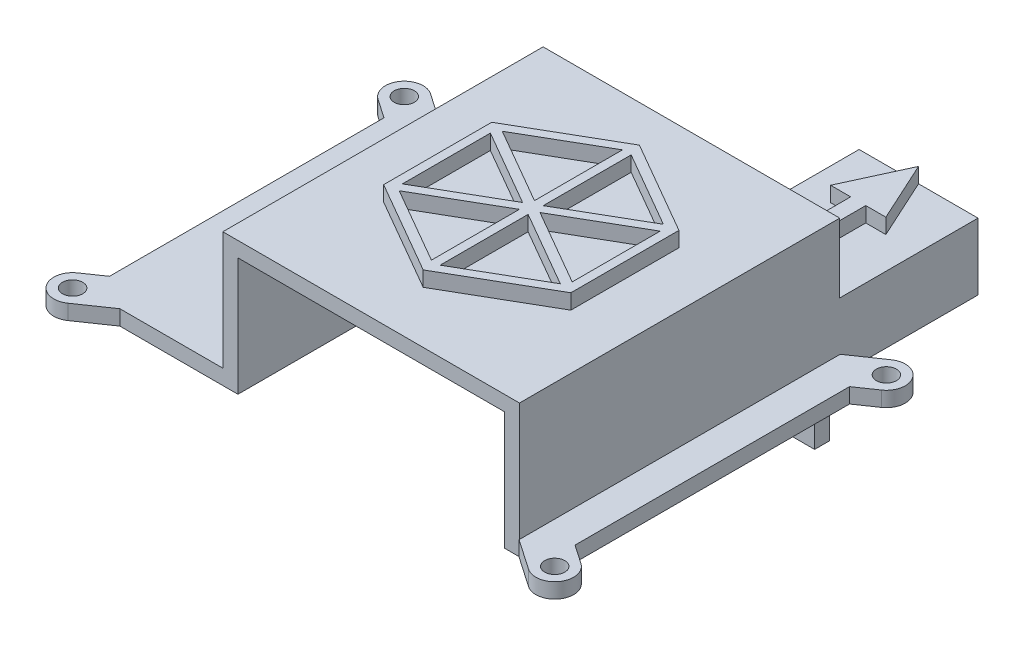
ISO-10303-21;
HEADER;
FILE_DESCRIPTION(('STEP AP214'),'2;1');
FILE_NAME('part.step','',(''),(''),'','','');
FILE_SCHEMA(('AUTOMOTIVE_DESIGN { 1 0 10303 214 1 1 1 1 }'));
ENDSEC;
DATA;
#1=APPLICATION_CONTEXT('core data for automotive mechanical design processes');
#2=APPLICATION_PROTOCOL_DEFINITION('international standard','automotive_design',2000,#1);
#3=PRODUCT_CONTEXT('',#1,'mechanical');
#4=PRODUCT('Part','Part','',(#3));
#5=PRODUCT_RELATED_PRODUCT_CATEGORY('part','',(#4));
#6=PRODUCT_DEFINITION_FORMATION('','',#4);
#7=PRODUCT_DEFINITION_CONTEXT('part definition',#1,'design');
#8=PRODUCT_DEFINITION('design','',#6,#7);
#9=PRODUCT_DEFINITION_SHAPE('','',#8);
#10=(LENGTH_UNIT() NAMED_UNIT(*) SI_UNIT(.MILLI.,.METRE.));
#11=(NAMED_UNIT(*) PLANE_ANGLE_UNIT() SI_UNIT($,.RADIAN.));
#12=(NAMED_UNIT(*) SI_UNIT($,.STERADIAN.) SOLID_ANGLE_UNIT());
#13=UNCERTAINTY_MEASURE_WITH_UNIT(LENGTH_MEASURE(1.E-05),#10,'distance_accuracy_value','');
#14=(GEOMETRIC_REPRESENTATION_CONTEXT(3) GLOBAL_UNCERTAINTY_ASSIGNED_CONTEXT((#13)) GLOBAL_UNIT_ASSIGNED_CONTEXT((#10,
#11,#12)) REPRESENTATION_CONTEXT('',''));
#15=CARTESIAN_POINT('',(0.,0.,0.));
#16=DIRECTION('',(0.,0.,1.));
#17=DIRECTION('',(1.,0.,0.));
#18=AXIS2_PLACEMENT_3D('',#15,#16,#17);
#19=CARTESIAN_POINT('',(-85.9833885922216,3.,-63.7));
#20=DIRECTION('',(0.,0.,1.));
#21=DIRECTION('',(1.,0.,0.));
#22=AXIS2_PLACEMENT_3D('',#19,#20,#21);
#23=PLANE('',#22);
#24=DIRECTION('',(-1.,0.,0.));
#25=VECTOR('',#24,1.);
#26=CARTESIAN_POINT('',(0.,4.5,-63.7));
#27=LINE('',#26,#25);
#28=CARTESIAN_POINT('',(-31.85,4.5,-63.7));
#29=VERTEX_POINT('',#28);
#30=CARTESIAN_POINT('',(-32.85,4.5,-63.7));
#31=VERTEX_POINT('',#30);
#32=EDGE_CURVE('E702',#29,#31,#27,.T.);
#33=ORIENTED_EDGE('',*,*,#32,.T.);
#34=DIRECTION('',(0.,1.,0.));
#35=VECTOR('',#34,1.);
#36=CARTESIAN_POINT('',(-32.85,0.,-63.7));
#37=LINE('',#36,#35);
#38=CARTESIAN_POINT('',(-32.85,11.75,-63.7));
#39=VERTEX_POINT('',#38);
#40=EDGE_CURVE('E1094',#31,#39,#37,.T.);
#41=ORIENTED_EDGE('',*,*,#40,.T.);
#42=DIRECTION('',(-1.,0.,0.));
#43=VECTOR('',#42,1.);
#44=CARTESIAN_POINT('',(0.,11.75,-63.7));
#45=LINE('',#44,#43);
#46=CARTESIAN_POINT('',(-62.5,11.75,-63.7));
#47=VERTEX_POINT('',#46);
#48=EDGE_CURVE('E731',#39,#47,#45,.T.);
#49=ORIENTED_EDGE('',*,*,#48,.T.);
#50=DIRECTION('',(0.,1.,0.));
#51=VECTOR('',#50,1.);
#52=CARTESIAN_POINT('',(-62.5,3.,-63.7));
#53=LINE('',#52,#51);
#54=CARTESIAN_POINT('',(-62.5,4.5,-63.7));
#55=VERTEX_POINT('',#54);
#56=EDGE_CURVE('E1281',#55,#47,#53,.T.);
#57=ORIENTED_EDGE('',*,*,#56,.F.);
#58=DIRECTION('',(1.,0.,0.));
#59=VECTOR('',#58,1.);
#60=CARTESIAN_POINT('',(0.,4.5,-63.7));
#61=LINE('',#60,#59);
#62=CARTESIAN_POINT('',(-63.5,4.5,-63.7));
#63=VERTEX_POINT('',#62);
#64=EDGE_CURVE('E708',#63,#55,#61,.T.);
#65=ORIENTED_EDGE('',*,*,#64,.F.);
#66=DIRECTION('',(0.,1.,0.));
#67=VECTOR('',#66,1.);
#68=CARTESIAN_POINT('',(-63.5,0.,-63.7));
#69=LINE('',#68,#67);
#70=CARTESIAN_POINT('',(-63.5,2.5,-63.7));
#71=VERTEX_POINT('',#70);
#72=EDGE_CURVE('E720',#71,#63,#69,.T.);
#73=ORIENTED_EDGE('',*,*,#72,.F.);
#74=DIRECTION('',(1.,0.,0.));
#75=VECTOR('',#74,1.);
#76=CARTESIAN_POINT('',(0.,2.49999999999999,-63.7));
#77=LINE('',#76,#75);
#78=CARTESIAN_POINT('',(-31.85,2.5,-63.7));
#79=VERTEX_POINT('',#78);
#80=EDGE_CURVE('E1182',#71,#79,#77,.T.);
#81=ORIENTED_EDGE('',*,*,#80,.T.);
#82=DIRECTION('',(0.,1.,0.));
#83=VECTOR('',#82,1.);
#84=CARTESIAN_POINT('',(-31.85,0.,-63.7));
#85=LINE('',#84,#83);
#86=EDGE_CURVE('E744',#79,#29,#85,.T.);
#87=ORIENTED_EDGE('',*,*,#86,.T.);
#88=EDGE_LOOP('',(#33,#41,#49,#57,#65,#73,#81,#87));
#89=FACE_BOUND('',#88,.T.);
#90=DIRECTION('',(0.,-1.,0.));
#91=VECTOR('',#90,1.);
#92=CARTESIAN_POINT('',(-19.8241672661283,15.75,-63.7));
#93=LINE('',#92,#91);
#94=CARTESIAN_POINT('',(-19.8241672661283,15.75,-63.7));
#95=VERTEX_POINT('',#94);
#96=CARTESIAN_POINT('',(-19.8241672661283,12.75,-63.7));
#97=VERTEX_POINT('',#96);
#98=EDGE_CURVE('E677',#95,#97,#93,.T.);
#99=ORIENTED_EDGE('',*,*,#98,.T.);
#100=DIRECTION('',(1.,0.,0.));
#101=VECTOR('',#100,1.);
#102=CARTESIAN_POINT('',(0.,12.75,-63.7));
#103=LINE('',#102,#101);
#104=CARTESIAN_POINT('',(-30.1483345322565,12.75,-63.7));
#105=VERTEX_POINT('',#104);
#106=EDGE_CURVE('E1148',#105,#97,#103,.T.);
#107=ORIENTED_EDGE('',*,*,#106,.F.);
#108=DIRECTION('',(0.,1.,0.));
#109=VECTOR('',#108,1.);
#110=CARTESIAN_POINT('',(-30.1483345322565,0.,-63.7));
#111=LINE('',#110,#109);
#112=CARTESIAN_POINT('',(-30.1483345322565,-0.500000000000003,-63.7));
#113=VERTEX_POINT('',#112);
#114=EDGE_CURVE('E1144',#113,#105,#111,.T.);
#115=ORIENTED_EDGE('',*,*,#114,.F.);
#116=DIRECTION('',(1.,0.,0.));
#117=VECTOR('',#116,1.);
#118=CARTESIAN_POINT('',(0.,-0.500000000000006,-63.7));
#119=LINE('',#118,#117);
#120=CARTESIAN_POINT('',(-8.5,-0.500000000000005,-63.7));
#121=VERTEX_POINT('',#120);
#122=EDGE_CURVE('E1156',#113,#121,#119,.T.);
#123=ORIENTED_EDGE('',*,*,#122,.T.);
#124=DIRECTION('',(0.,-1.,0.));
#125=VECTOR('',#124,1.);
#126=CARTESIAN_POINT('',(-8.5,0.,-63.7));
#127=LINE('',#126,#125);
#128=CARTESIAN_POINT('',(-8.5,-12.85,-63.7));
#129=VERTEX_POINT('',#128);
#130=EDGE_CURVE('E1228',#121,#129,#127,.T.);
#131=ORIENTED_EDGE('',*,*,#130,.T.);
#132=DIRECTION('',(1.,0.,0.));
#133=VECTOR('',#132,1.);
#134=CARTESIAN_POINT('',(-20.,-12.85,-63.7));
#135=LINE('',#134,#133);
#136=CARTESIAN_POINT('',(-20.,-12.85,-63.7));
#137=VERTEX_POINT('',#136);
#138=EDGE_CURVE('E176',#137,#129,#135,.T.);
#139=ORIENTED_EDGE('',*,*,#138,.F.);
#140=DIRECTION('',(0.,1.,0.));
#141=VECTOR('',#140,1.);
#142=CARTESIAN_POINT('',(-20.,0.,-63.7));
#143=LINE('',#142,#141);
#144=CARTESIAN_POINT('',(-20.,-10.1,-63.7));
#145=VERTEX_POINT('',#144);
#146=EDGE_CURVE('E1233',#137,#145,#143,.T.);
#147=ORIENTED_EDGE('',*,*,#146,.T.);
#148=DIRECTION('',(-1.,0.,0.));
#149=VECTOR('',#148,1.);
#150=CARTESIAN_POINT('',(0.,-10.1,-63.7));
#151=LINE('',#150,#149);
#152=CARTESIAN_POINT('',(-45.,-10.1,-63.7));
#153=VERTEX_POINT('',#152);
#154=EDGE_CURVE('E1236',#145,#153,#151,.T.);
#155=ORIENTED_EDGE('',*,*,#154,.T.);
#156=DIRECTION('',(-0.999512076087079,-0.0312347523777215,0.));
#157=VECTOR('',#156,1.);
#158=CARTESIAN_POINT('',(0.271414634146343,-8.68526829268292,-63.7));
#159=LINE('',#158,#157);
#160=CARTESIAN_POINT('',(-53.,-10.35,-63.7));
#161=VERTEX_POINT('',#160);
#162=EDGE_CURVE('E1240',#153,#161,#159,.T.);
#163=ORIENTED_EDGE('',*,*,#162,.T.);
#164=DIRECTION('',(1.,0.,0.));
#165=VECTOR('',#164,1.);
#166=CARTESIAN_POINT('',(0.,-10.35,-63.7));
#167=LINE('',#166,#165);
#168=CARTESIAN_POINT('',(-60.5,-10.35,-63.7));
#169=VERTEX_POINT('',#168);
#170=EDGE_CURVE('E1244',#169,#161,#167,.T.);
#171=ORIENTED_EDGE('',*,*,#170,.F.);
#172=DIRECTION('',(0.,-1.,0.));
#173=VECTOR('',#172,1.);
#174=CARTESIAN_POINT('',(-60.5,0.,-63.7));
#175=LINE('',#174,#173);
#176=CARTESIAN_POINT('',(-60.5,0.,-63.7));
#177=VERTEX_POINT('',#176);
#178=EDGE_CURVE('E1188',#177,#169,#175,.T.);
#179=ORIENTED_EDGE('',*,*,#178,.F.);
#180=DIRECTION('',(-1.,0.,0.));
#181=VECTOR('',#180,1.);
#182=CARTESIAN_POINT('',(-85.9833885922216,0.,-63.7));
#183=LINE('',#182,#181);
#184=CARTESIAN_POINT('',(-85.9833885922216,0.,-63.7));
#185=VERTEX_POINT('',#184);
#186=EDGE_CURVE('E1469',#177,#185,#183,.T.);
#187=ORIENTED_EDGE('',*,*,#186,.T.);
#188=DIRECTION('',(0.,-1.,0.));
#189=VECTOR('',#188,1.);
#190=CARTESIAN_POINT('',(-85.9833885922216,3.,-63.7));
#191=LINE('',#190,#189);
#192=CARTESIAN_POINT('',(-85.9833885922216,3.,-63.7));
#193=VERTEX_POINT('',#192);
#194=EDGE_CURVE('E1479',#193,#185,#191,.T.);
#195=ORIENTED_EDGE('',*,*,#194,.F.);
#196=DIRECTION('',(-1.,0.,0.));
#197=VECTOR('',#196,1.);
#198=CARTESIAN_POINT('',(-85.9833885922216,3.,-63.7));
#199=LINE('',#198,#197);
#200=CARTESIAN_POINT('',(-65.5,3.,-63.7));
#201=VERTEX_POINT('',#200);
#202=EDGE_CURVE('E1417',#201,#193,#199,.T.);
#203=ORIENTED_EDGE('',*,*,#202,.F.);
#204=DIRECTION('',(0.,1.,0.));
#205=VECTOR('',#204,1.);
#206=CARTESIAN_POINT('',(-65.5,0.,-63.7));
#207=LINE('',#206,#205);
#208=CARTESIAN_POINT('',(-65.5,26.5,-63.7));
#209=VERTEX_POINT('',#208);
#210=EDGE_CURVE('E1285',#201,#209,#207,.T.);
#211=ORIENTED_EDGE('',*,*,#210,.T.);
#212=DIRECTION('',(1.,0.,0.));
#213=VECTOR('',#212,1.);
#214=CARTESIAN_POINT('',(0.,26.5,-63.7));
#215=LINE('',#214,#213);
#216=CARTESIAN_POINT('',(-6.49999999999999,26.5,-63.7));
#217=VERTEX_POINT('',#216);
#218=EDGE_CURVE('E1290',#209,#217,#215,.T.);
#219=ORIENTED_EDGE('',*,*,#218,.T.);
#220=DIRECTION('',(0.,-1.,0.));
#221=VECTOR('',#220,1.);
#222=CARTESIAN_POINT('',(-6.5,0.,-63.7));
#223=LINE('',#222,#221);
#224=CARTESIAN_POINT('',(-6.5,12.75,-63.7));
#225=VERTEX_POINT('',#224);
#226=EDGE_CURVE('E1286',#217,#225,#223,.T.);
#227=ORIENTED_EDGE('',*,*,#226,.T.);
#228=CARTESIAN_POINT('',(-16.8241672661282,12.75,-63.7));
#229=VERTEX_POINT('',#228);
#230=EDGE_CURVE('E1147',#229,#225,#103,.T.);
#231=ORIENTED_EDGE('',*,*,#230,.F.);
#232=DIRECTION('',(0.,-1.,0.));
#233=VECTOR('',#232,1.);
#234=CARTESIAN_POINT('',(-16.8241672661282,15.75,-63.7));
#235=LINE('',#234,#233);
#236=CARTESIAN_POINT('',(-16.8241672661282,15.75,-63.7));
#237=VERTEX_POINT('',#236);
#238=EDGE_CURVE('E684',#237,#229,#235,.T.);
#239=ORIENTED_EDGE('',*,*,#238,.F.);
#240=DIRECTION('',(1.,0.,0.));
#241=VECTOR('',#240,1.);
#242=CARTESIAN_POINT('',(-19.8241672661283,15.75,-63.7));
#243=LINE('',#242,#241);
#244=EDGE_CURVE('E667',#95,#237,#243,.T.);
#245=ORIENTED_EDGE('',*,*,#244,.F.);
#246=EDGE_LOOP('',(#99,#107,#115,#123,#131,#139,#147,#155,#163,#171,#179,#187,#195,#203,#211,
#219,#227,#231,#239,#245));
#247=FACE_BOUND('',#246,.T.);
#248=ADVANCED_FACE('F161',(#89,#247),#23,.F.);
#249=CARTESIAN_POINT('',(0.,12.75,-88.2));
#250=DIRECTION('',(0.,-1.,0.));
#251=DIRECTION('',(0.,0.,-1.));
#252=AXIS2_PLACEMENT_3D('',#249,#250,#251);
#253=PLANE('',#252);
#254=ORIENTED_EDGE('',*,*,#106,.T.);
#255=DIRECTION('',(0.,0.,1.));
#256=VECTOR('',#255,1.);
#257=CARTESIAN_POINT('',(-19.8241672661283,12.75,-66.7));
#258=LINE('',#257,#256);
#259=CARTESIAN_POINT('',(-19.8241672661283,12.75,-79.2));
#260=VERTEX_POINT('',#259);
#261=EDGE_CURVE('E679',#260,#97,#258,.T.);
#262=ORIENTED_EDGE('',*,*,#261,.F.);
#263=DIRECTION('',(1.,0.,0.));
#264=VECTOR('',#263,1.);
#265=CARTESIAN_POINT('',(-19.8241672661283,12.75,-79.2));
#266=LINE('',#265,#264);
#267=CARTESIAN_POINT('',(-23.8241672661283,12.75,-79.2));
#268=VERTEX_POINT('',#267);
#269=EDGE_CURVE('E184',#268,#260,#266,.T.);
#270=ORIENTED_EDGE('',*,*,#269,.F.);
#271=DIRECTION('',(-0.416654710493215,0.,0.909064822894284));
#272=VECTOR('',#271,1.);
#273=CARTESIAN_POINT('',(-23.8241672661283,12.75,-79.2));
#274=LINE('',#273,#272);
#275=CARTESIAN_POINT('',(-18.3241672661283,12.75,-91.2));
#276=VERTEX_POINT('',#275);
#277=EDGE_CURVE('E768',#276,#268,#274,.T.);
#278=ORIENTED_EDGE('',*,*,#277,.F.);
#279=DIRECTION('',(-1.,0.,0.));
#280=VECTOR('',#279,1.);
#281=CARTESIAN_POINT('',(-6.5,12.75,-91.2));
#282=LINE('',#281,#280);
#283=CARTESIAN_POINT('',(-30.1483345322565,12.75,-91.2));
#284=VERTEX_POINT('',#283);
#285=EDGE_CURVE('E1086',#276,#284,#282,.T.);
#286=ORIENTED_EDGE('',*,*,#285,.T.);
#287=DIRECTION('',(0.,0.,1.));
#288=VECTOR('',#287,1.);
#289=CARTESIAN_POINT('',(-30.1483345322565,12.75,-88.2));
#290=LINE('',#289,#288);
#291=EDGE_CURVE('E1171',#284,#105,#290,.T.);
#292=ORIENTED_EDGE('',*,*,#291,.T.);
#293=EDGE_LOOP('',(#254,#262,#270,#278,#286,#292));
#294=FACE_BOUND('',#293,.T.);
#295=ADVANCED_FACE('F1618',(#294),#253,.F.);
#296=DIRECTION('',(0.,0.,-1.));
#297=VECTOR('',#296,1.);
#298=CARTESIAN_POINT('',(-16.8241672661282,12.75,-66.7));
#299=LINE('',#298,#297);
#300=CARTESIAN_POINT('',(-16.8241672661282,12.75,-79.2));
#301=VERTEX_POINT('',#300);
#302=EDGE_CURVE('E791',#229,#301,#299,.T.);
#303=ORIENTED_EDGE('',*,*,#302,.F.);
#304=ORIENTED_EDGE('',*,*,#230,.T.);
#305=DIRECTION('',(0.,0.,1.));
#306=VECTOR('',#305,1.);
#307=CARTESIAN_POINT('',(-6.5,12.75,-88.2));
#308=LINE('',#307,#306);
#309=CARTESIAN_POINT('',(-6.5,12.75,-91.2));
#310=VERTEX_POINT('',#309);
#311=EDGE_CURVE('E1167',#310,#225,#308,.T.);
#312=ORIENTED_EDGE('',*,*,#311,.F.);
#313=EDGE_CURVE('E1087',#310,#276,#282,.T.);
#314=ORIENTED_EDGE('',*,*,#313,.T.);
#315=DIRECTION('',(-0.416654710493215,0.,-0.909064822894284));
#316=VECTOR('',#315,1.);
#317=CARTESIAN_POINT('',(-12.8241672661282,12.75,-79.2));
#318=LINE('',#317,#316);
#319=CARTESIAN_POINT('',(-12.8241672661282,12.75,-79.2));
#320=VERTEX_POINT('',#319);
#321=EDGE_CURVE('E772',#320,#276,#318,.T.);
#322=ORIENTED_EDGE('',*,*,#321,.F.);
#323=DIRECTION('',(1.,0.,0.));
#324=VECTOR('',#323,1.);
#325=CARTESIAN_POINT('',(-16.8241672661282,12.75,-79.2));
#326=LINE('',#325,#324);
#327=EDGE_CURVE('E795',#301,#320,#326,.T.);
#328=ORIENTED_EDGE('',*,*,#327,.F.);
#329=EDGE_LOOP('',(#303,#304,#312,#314,#322,#328));
#330=FACE_BOUND('',#329,.T.);
#331=ADVANCED_FACE('F1692',(#330),#253,.F.);
#332=CARTESIAN_POINT('',(0.,0.,-60.7));
#333=DIRECTION('',(0.,0.,-1.));
#334=DIRECTION('',(-1.,0.,0.));
#335=AXIS2_PLACEMENT_3D('',#332,#333,#334);
#336=PLANE('',#335);
#337=DIRECTION('',(0.,1.,0.));
#338=VECTOR('',#337,1.);
#339=CARTESIAN_POINT('',(-20.,0.,-60.7));
#340=LINE('',#339,#338);
#341=CARTESIAN_POINT('',(-20.,-12.85,-60.7));
#342=VERTEX_POINT('',#341);
#343=CARTESIAN_POINT('',(-20.,-10.1,-60.7));
#344=VERTEX_POINT('',#343);
#345=EDGE_CURVE('E1204',#342,#344,#340,.T.);
#346=ORIENTED_EDGE('',*,*,#345,.F.);
#347=DIRECTION('',(1.,0.,0.));
#348=VECTOR('',#347,1.);
#349=CARTESIAN_POINT('',(0.,-12.85,-60.7));
#350=LINE('',#349,#348);
#351=CARTESIAN_POINT('',(-8.5,-12.85,-60.7));
#352=VERTEX_POINT('',#351);
#353=EDGE_CURVE('E698',#342,#352,#350,.T.);
#354=ORIENTED_EDGE('',*,*,#353,.T.);
#355=DIRECTION('',(0.,-1.,0.));
#356=VECTOR('',#355,1.);
#357=CARTESIAN_POINT('',(-8.5,0.,-60.7));
#358=LINE('',#357,#356);
#359=CARTESIAN_POINT('',(-8.49999999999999,0.,-60.7));
#360=VERTEX_POINT('',#359);
#361=EDGE_CURVE('E1200',#360,#352,#358,.T.);
#362=ORIENTED_EDGE('',*,*,#361,.F.);
#363=DIRECTION('',(-1.,0.,0.));
#364=VECTOR('',#363,1.);
#365=CARTESIAN_POINT('',(0.,0.,-60.7));
#366=LINE('',#365,#364);
#367=CARTESIAN_POINT('',(-9.5,0.,-60.7));
#368=VERTEX_POINT('',#367);
#369=EDGE_CURVE('E1196',#360,#368,#366,.T.);
#370=ORIENTED_EDGE('',*,*,#369,.T.);
#371=DIRECTION('',(0.,1.,0.));
#372=VECTOR('',#371,1.);
#373=CARTESIAN_POINT('',(-9.5,0.,-60.7));
#374=LINE('',#373,#372);
#375=CARTESIAN_POINT('',(-9.5,2.5,-60.7));
#376=VERTEX_POINT('',#375);
#377=EDGE_CURVE('E1192',#368,#376,#374,.T.);
#378=ORIENTED_EDGE('',*,*,#377,.T.);
#379=DIRECTION('',(1.,0.,0.));
#380=VECTOR('',#379,1.);
#381=CARTESIAN_POINT('',(0.,2.49999999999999,-60.7));
#382=LINE('',#381,#380);
#383=CARTESIAN_POINT('',(-27.1483345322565,2.5,-60.7));
#384=VERTEX_POINT('',#383);
#385=EDGE_CURVE('E1187',#384,#376,#382,.T.);
#386=ORIENTED_EDGE('',*,*,#385,.F.);
#387=DIRECTION('',(0.,1.,0.));
#388=VECTOR('',#387,1.);
#389=CARTESIAN_POINT('',(-27.1483345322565,0.,-60.7));
#390=LINE('',#389,#388);
#391=CARTESIAN_POINT('',(-27.1483345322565,9.74999999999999,-60.7));
#392=VERTEX_POINT('',#391);
#393=EDGE_CURVE('E1099',#384,#392,#390,.T.);
#394=ORIENTED_EDGE('',*,*,#393,.T.);
#395=DIRECTION('',(1.,0.,0.));
#396=VECTOR('',#395,1.);
#397=CARTESIAN_POINT('',(0.,9.74999999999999,-60.7));
#398=LINE('',#397,#396);
#399=CARTESIAN_POINT('',(-9.5,9.74999999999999,-60.7));
#400=VERTEX_POINT('',#399);
#401=EDGE_CURVE('E1095',#392,#400,#398,.T.);
#402=ORIENTED_EDGE('',*,*,#401,.T.);
#403=DIRECTION('',(0.,1.,0.));
#404=VECTOR('',#403,1.);
#405=CARTESIAN_POINT('',(-9.5,0.,-60.7));
#406=LINE('',#405,#404);
#407=CARTESIAN_POINT('',(-9.49999999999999,23.5,-60.7));
#408=VERTEX_POINT('',#407);
#409=EDGE_CURVE('E1114',#400,#408,#406,.T.);
#410=ORIENTED_EDGE('',*,*,#409,.T.);
#411=DIRECTION('',(-1.,0.,0.));
#412=VECTOR('',#411,1.);
#413=CARTESIAN_POINT('',(0.,23.5,-60.7));
#414=LINE('',#413,#412);
#415=CARTESIAN_POINT('',(-62.5,23.5,-60.7));
#416=VERTEX_POINT('',#415);
#417=EDGE_CURVE('E1110',#408,#416,#414,.T.);
#418=ORIENTED_EDGE('',*,*,#417,.T.);
#419=DIRECTION('',(0.,-1.,0.));
#420=VECTOR('',#419,1.);
#421=CARTESIAN_POINT('',(-62.5,0.,-60.7));
#422=LINE('',#421,#420);
#423=CARTESIAN_POINT('',(-62.5,11.75,-60.7));
#424=VERTEX_POINT('',#423);
#425=EDGE_CURVE('E1106',#416,#424,#422,.T.);
#426=ORIENTED_EDGE('',*,*,#425,.T.);
#427=DIRECTION('',(-1.,0.,0.));
#428=VECTOR('',#427,1.);
#429=CARTESIAN_POINT('',(0.,11.75,-60.7));
#430=LINE('',#429,#428);
#431=CARTESIAN_POINT('',(-32.85,11.75,-60.7));
#432=VERTEX_POINT('',#431);
#433=EDGE_CURVE('E1539',#432,#424,#430,.T.);
#434=ORIENTED_EDGE('',*,*,#433,.F.);
#435=DIRECTION('',(0.,1.,0.));
#436=VECTOR('',#435,1.);
#437=CARTESIAN_POINT('',(-32.85,0.,-60.7));
#438=LINE('',#437,#436);
#439=CARTESIAN_POINT('',(-32.85,4.5,-60.7));
#440=VERTEX_POINT('',#439);
#441=EDGE_CURVE('E1103',#440,#432,#438,.T.);
#442=ORIENTED_EDGE('',*,*,#441,.F.);
#443=DIRECTION('',(-1.,0.,0.));
#444=VECTOR('',#443,1.);
#445=CARTESIAN_POINT('',(0.,4.5,-60.7));
#446=LINE('',#445,#444);
#447=CARTESIAN_POINT('',(-31.85,4.5,-60.7));
#448=VERTEX_POINT('',#447);
#449=EDGE_CURVE('E762',#448,#440,#446,.T.);
#450=ORIENTED_EDGE('',*,*,#449,.F.);
#451=DIRECTION('',(0.,1.,0.));
#452=VECTOR('',#451,1.);
#453=CARTESIAN_POINT('',(-31.85,0.,-60.7));
#454=LINE('',#453,#452);
#455=CARTESIAN_POINT('',(-31.85,2.5,-60.7));
#456=VERTEX_POINT('',#455);
#457=EDGE_CURVE('E170',#456,#448,#454,.T.);
#458=ORIENTED_EDGE('',*,*,#457,.F.);
#459=CARTESIAN_POINT('',(-62.5,2.5,-60.7));
#460=VERTEX_POINT('',#459);
#461=EDGE_CURVE('E1189',#460,#456,#382,.T.);
#462=ORIENTED_EDGE('',*,*,#461,.F.);
#463=DIRECTION('',(0.,-1.,0.));
#464=VECTOR('',#463,1.);
#465=CARTESIAN_POINT('',(-62.5,0.,-60.7));
#466=LINE('',#465,#464);
#467=CARTESIAN_POINT('',(-62.5,0.,-60.7));
#468=VERTEX_POINT('',#467);
#469=EDGE_CURVE('E1183',#460,#468,#466,.T.);
#470=ORIENTED_EDGE('',*,*,#469,.T.);
#471=DIRECTION('',(-1.,0.,0.));
#472=VECTOR('',#471,1.);
#473=CARTESIAN_POINT('',(0.,0.,-60.7));
#474=LINE('',#473,#472);
#475=CARTESIAN_POINT('',(-60.5,0.,-60.7));
#476=VERTEX_POINT('',#475);
#477=EDGE_CURVE('E1221',#476,#468,#474,.T.);
#478=ORIENTED_EDGE('',*,*,#477,.F.);
#479=DIRECTION('',(0.,-1.,0.));
#480=VECTOR('',#479,1.);
#481=CARTESIAN_POINT('',(-60.5,0.,-60.7));
#482=LINE('',#481,#480);
#483=CARTESIAN_POINT('',(-60.5,-10.35,-60.7));
#484=VERTEX_POINT('',#483);
#485=EDGE_CURVE('E1218',#476,#484,#482,.T.);
#486=ORIENTED_EDGE('',*,*,#485,.T.);
#487=DIRECTION('',(1.,0.,0.));
#488=VECTOR('',#487,1.);
#489=CARTESIAN_POINT('',(0.,-10.35,-60.7));
#490=LINE('',#489,#488);
#491=CARTESIAN_POINT('',(-53.,-10.35,-60.7));
#492=VERTEX_POINT('',#491);
#493=EDGE_CURVE('E1215',#484,#492,#490,.T.);
#494=ORIENTED_EDGE('',*,*,#493,.T.);
#495=DIRECTION('',(-0.999512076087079,-0.0312347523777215,0.));
#496=VECTOR('',#495,1.);
#497=CARTESIAN_POINT('',(0.271414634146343,-8.68526829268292,-60.7));
#498=LINE('',#497,#496);
#499=CARTESIAN_POINT('',(-45.,-10.1,-60.7));
#500=VERTEX_POINT('',#499);
#501=EDGE_CURVE('E1211',#500,#492,#498,.T.);
#502=ORIENTED_EDGE('',*,*,#501,.F.);
#503=DIRECTION('',(-1.,0.,0.));
#504=VECTOR('',#503,1.);
#505=CARTESIAN_POINT('',(0.,-10.1,-60.7));
#506=LINE('',#505,#504);
#507=EDGE_CURVE('E1207',#344,#500,#506,.T.);
#508=ORIENTED_EDGE('',*,*,#507,.F.);
#509=EDGE_LOOP('',(#346,#354,#362,#370,#378,#386,#394,#402,#410,#418,#426,#434,#442,#450,#458,
#462,#470,#478,#486,#494,#502,#508));
#510=FACE_BOUND('',#509,.T.);
#511=ADVANCED_FACE('F1556',(#510),#336,.F.);
#512=CARTESIAN_POINT('',(-32.85,0.,-60.7));
#513=DIRECTION('',(-1.,0.,0.));
#514=DIRECTION('',(0.,0.,1.));
#515=AXIS2_PLACEMENT_3D('',#512,#513,#514);
#516=PLANE('',#515);
#517=ORIENTED_EDGE('',*,*,#40,.F.);
#518=DIRECTION('',(0.,0.,1.));
#519=VECTOR('',#518,1.);
#520=CARTESIAN_POINT('',(-32.85,4.5,-60.7));
#521=LINE('',#520,#519);
#522=EDGE_CURVE('E1535',#31,#440,#521,.T.);
#523=ORIENTED_EDGE('',*,*,#522,.T.);
#524=ORIENTED_EDGE('',*,*,#441,.T.);
#525=DIRECTION('',(0.,0.,-1.));
#526=VECTOR('',#525,1.);
#527=CARTESIAN_POINT('',(-32.85,11.75,-38.7));
#528=LINE('',#527,#526);
#529=EDGE_CURVE('E758',#432,#39,#528,.T.);
#530=ORIENTED_EDGE('',*,*,#529,.T.);
#531=EDGE_LOOP('',(#517,#523,#524,#530));
#532=FACE_BOUND('',#531,.T.);
#533=ADVANCED_FACE('F1561',(#532),#516,.T.);
#534=CARTESIAN_POINT('',(0.,26.5,-128.378048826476));
#535=DIRECTION('',(0.,1.,0.));
#536=DIRECTION('',(0.,0.,1.));
#537=AXIS2_PLACEMENT_3D('',#534,#535,#536);
#538=PLANE('',#537);
#539=ORIENTED_EDGE('',*,*,#218,.F.);
#540=DIRECTION('',(0.,0.,1.));
#541=VECTOR('',#540,1.);
#542=CARTESIAN_POINT('',(-65.5,26.5,-128.378048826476));
#543=LINE('',#542,#541);
#544=CARTESIAN_POINT('',(-65.5,26.5,0.));
#545=VERTEX_POINT('',#544);
#546=EDGE_CURVE('E1291',#209,#545,#543,.T.);
#547=ORIENTED_EDGE('',*,*,#546,.T.);
#548=DIRECTION('',(-1.,0.,0.));
#549=VECTOR('',#548,1.);
#550=CARTESIAN_POINT('',(0.,26.5,0.));
#551=LINE('',#550,#549);
#552=CARTESIAN_POINT('',(-6.49999999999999,26.5,0.));
#553=VERTEX_POINT('',#552);
#554=EDGE_CURVE('E1320',#553,#545,#551,.T.);
#555=ORIENTED_EDGE('',*,*,#554,.F.);
#556=DIRECTION('',(0.,0.,1.));
#557=VECTOR('',#556,1.);
#558=CARTESIAN_POINT('',(-6.49999999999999,26.5,-128.378048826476));
#559=LINE('',#558,#557);
#560=EDGE_CURVE('E1324',#217,#553,#559,.T.);
#561=ORIENTED_EDGE('',*,*,#560,.F.);
#562=EDGE_LOOP('',(#539,#547,#555,#561));
#563=FACE_BOUND('',#562,.T.);
#564=DIRECTION('',(-0.866025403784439,0.,0.5));
#565=VECTOR('',#564,1.);
#566=CARTESIAN_POINT('',(-32.1012276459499,26.5,-55.6009572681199));
#567=LINE('',#566,#565);
#568=CARTESIAN_POINT('',(-36.,26.5,-53.35));
#569=VERTEX_POINT('',#568);
#570=CARTESIAN_POINT('',(-54.6195461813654,26.5,-42.6));
#571=VERTEX_POINT('',#570);
#572=EDGE_CURVE('E970',#569,#571,#567,.T.);
#573=ORIENTED_EDGE('',*,*,#572,.F.);
#574=DIRECTION('',(-0.866025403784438,0.,-0.5));
#575=VECTOR('',#574,1.);
#576=CARTESIAN_POINT('',(14.1012276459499,26.5,-24.4240427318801));
#577=LINE('',#576,#575);
#578=CARTESIAN_POINT('',(-17.3804538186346,26.5,-42.6));
#579=VERTEX_POINT('',#578);
#580=EDGE_CURVE('E966',#579,#569,#577,.T.);
#581=ORIENTED_EDGE('',*,*,#580,.F.);
#582=DIRECTION('',(0.,0.,-1.));
#583=VECTOR('',#582,1.);
#584=CARTESIAN_POINT('',(-17.3804538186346,26.5,0.));
#585=LINE('',#584,#583);
#586=CARTESIAN_POINT('',(-17.3804538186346,26.5,-21.1));
#587=VERTEX_POINT('',#586);
#588=EDGE_CURVE('E825',#587,#579,#585,.T.);
#589=ORIENTED_EDGE('',*,*,#588,.F.);
#590=DIRECTION('',(0.866025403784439,0.,-0.5));
#591=VECTOR('',#590,1.);
#592=CARTESIAN_POINT('',(-13.4816814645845,26.5,-23.3509572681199));
#593=LINE('',#592,#591);
#594=CARTESIAN_POINT('',(-36.,26.5,-10.35));
#595=VERTEX_POINT('',#594);
#596=EDGE_CURVE('E979',#595,#587,#593,.T.);
#597=ORIENTED_EDGE('',*,*,#596,.F.);
#598=DIRECTION('',(0.866025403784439,0.,0.5));
#599=VECTOR('',#598,1.);
#600=CARTESIAN_POINT('',(-4.5183185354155,26.5,7.82595726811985));
#601=LINE('',#600,#599);
#602=CARTESIAN_POINT('',(-54.6195461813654,26.5,-21.1));
#603=VERTEX_POINT('',#602);
#604=EDGE_CURVE('E976',#603,#595,#601,.T.);
#605=ORIENTED_EDGE('',*,*,#604,.F.);
#606=DIRECTION('',(0.,0.,1.));
#607=VECTOR('',#606,1.);
#608=CARTESIAN_POINT('',(-54.6195461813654,26.5,0.));
#609=LINE('',#608,#607);
#610=EDGE_CURVE('E973',#571,#603,#609,.T.);
#611=ORIENTED_EDGE('',*,*,#610,.F.);
#612=EDGE_LOOP('',(#573,#581,#589,#597,#605,#611));
#613=FACE_BOUND('',#612,.T.);
#614=ADVANCED_FACE('F1678',(#563,#613),#538,.T.);
#615=CARTESIAN_POINT('',(-9.5,3.,-128.378048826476));
#616=DIRECTION('',(1.,0.,0.));
#617=DIRECTION('',(0.,1.,0.));
#618=AXIS2_PLACEMENT_3D('',#615,#616,#617);
#619=PLANE('',#618);
#620=ORIENTED_EDGE('',*,*,#409,.F.);
#621=DIRECTION('',(0.,0.,1.));
#622=VECTOR('',#621,1.);
#623=CARTESIAN_POINT('',(-9.5,9.74999999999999,-88.2));
#624=LINE('',#623,#622);
#625=CARTESIAN_POINT('',(-9.5,9.74999999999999,-88.2));
#626=VERTEX_POINT('',#625);
#627=EDGE_CURVE('E1138',#626,#400,#624,.T.);
#628=ORIENTED_EDGE('',*,*,#627,.F.);
#629=DIRECTION('',(0.,1.,0.));
#630=VECTOR('',#629,1.);
#631=CARTESIAN_POINT('',(-9.5,0.,-88.2));
#632=LINE('',#631,#630);
#633=CARTESIAN_POINT('',(-9.5,2.5,-88.2));
#634=VERTEX_POINT('',#633);
#635=EDGE_CURVE('E1127',#634,#626,#632,.T.);
#636=ORIENTED_EDGE('',*,*,#635,.F.);
#637=DIRECTION('',(0.,0.,-1.));
#638=VECTOR('',#637,1.);
#639=CARTESIAN_POINT('',(-9.5,2.5,-60.7));
#640=LINE('',#639,#638);
#641=EDGE_CURVE('E1225',#376,#634,#640,.T.);
#642=ORIENTED_EDGE('',*,*,#641,.F.);
#643=ORIENTED_EDGE('',*,*,#377,.F.);
#644=DIRECTION('',(0.,0.,-1.));
#645=VECTOR('',#644,1.);
#646=CARTESIAN_POINT('',(-9.5,0.,0.));
#647=LINE('',#646,#645);
#648=CARTESIAN_POINT('',(-9.5,0.,0.));
#649=VERTEX_POINT('',#648);
#650=EDGE_CURVE('E1254',#649,#368,#647,.T.);
#651=ORIENTED_EDGE('',*,*,#650,.F.);
#652=DIRECTION('',(0.,1.,0.));
#653=VECTOR('',#652,1.);
#654=CARTESIAN_POINT('',(-9.5,3.,0.));
#655=LINE('',#654,#653);
#656=CARTESIAN_POINT('',(-9.49999999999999,23.5,0.));
#657=VERTEX_POINT('',#656);
#658=EDGE_CURVE('E1299',#649,#657,#655,.T.);
#659=ORIENTED_EDGE('',*,*,#658,.T.);
#660=DIRECTION('',(0.,0.,1.));
#661=VECTOR('',#660,1.);
#662=CARTESIAN_POINT('',(-9.49999999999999,23.5,-128.378048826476));
#663=LINE('',#662,#661);
#664=EDGE_CURVE('E1307',#408,#657,#663,.T.);
#665=ORIENTED_EDGE('',*,*,#664,.F.);
#666=EDGE_LOOP('',(#620,#628,#636,#642,#643,#651,#659,#665));
#667=FACE_BOUND('',#666,.T.);
#668=ADVANCED_FACE('F1643',(#667),#619,.F.);
#669=CARTESIAN_POINT('',(-62.5,23.5,-128.378048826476));
#670=DIRECTION('',(0.,1.,0.));
#671=DIRECTION('',(0.,0.,1.));
#672=AXIS2_PLACEMENT_3D('',#669,#670,#671);
#673=PLANE('',#672);
#674=ORIENTED_EDGE('',*,*,#417,.F.);
#675=ORIENTED_EDGE('',*,*,#664,.T.);
#676=DIRECTION('',(-1.,0.,0.));
#677=VECTOR('',#676,1.);
#678=CARTESIAN_POINT('',(-62.5,23.5,0.));
#679=LINE('',#678,#677);
#680=CARTESIAN_POINT('',(-62.5,23.5,0.));
#681=VERTEX_POINT('',#680);
#682=EDGE_CURVE('E1303',#657,#681,#679,.T.);
#683=ORIENTED_EDGE('',*,*,#682,.T.);
#684=DIRECTION('',(0.,0.,1.));
#685=VECTOR('',#684,1.);
#686=CARTESIAN_POINT('',(-62.5,23.5,-128.378048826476));
#687=LINE('',#686,#685);
#688=EDGE_CURVE('E1308',#416,#681,#687,.T.);
#689=ORIENTED_EDGE('',*,*,#688,.F.);
#690=EDGE_LOOP('',(#674,#675,#683,#689));
#691=FACE_BOUND('',#690,.T.);
#692=ADVANCED_FACE('F1794',(#691),#673,.F.);
#693=CARTESIAN_POINT('',(-62.5,3.,-128.378048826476));
#694=DIRECTION('',(-1.,0.,0.));
#695=DIRECTION('',(0.,0.,1.));
#696=AXIS2_PLACEMENT_3D('',#693,#694,#695);
#697=PLANE('',#696);
#698=ORIENTED_EDGE('',*,*,#469,.F.);
#699=DIRECTION('',(0.,0.,-1.));
#700=VECTOR('',#699,1.);
#701=CARTESIAN_POINT('',(-62.5,2.5,-38.7));
#702=LINE('',#701,#700);
#703=CARTESIAN_POINT('',(-62.5,2.5,-38.7));
#704=VERTEX_POINT('',#703);
#705=EDGE_CURVE('E732',#704,#460,#702,.T.);
#706=ORIENTED_EDGE('',*,*,#705,.F.);
#707=DIRECTION('',(0.,-1.,0.));
#708=VECTOR('',#707,1.);
#709=CARTESIAN_POINT('',(-62.5,0.,-38.7));
#710=LINE('',#709,#708);
#711=CARTESIAN_POINT('',(-62.5,4.5,-38.7));
#712=VERTEX_POINT('',#711);
#713=EDGE_CURVE('E712',#712,#704,#710,.T.);
#714=ORIENTED_EDGE('',*,*,#713,.F.);
#715=DIRECTION('',(0.,0.,-1.));
#716=VECTOR('',#715,1.);
#717=CARTESIAN_POINT('',(-62.5,4.5,-38.7));
#718=LINE('',#717,#716);
#719=EDGE_CURVE('E735',#712,#55,#718,.T.);
#720=ORIENTED_EDGE('',*,*,#719,.T.);
#721=ORIENTED_EDGE('',*,*,#56,.T.);
#722=DIRECTION('',(0.,0.,-1.));
#723=VECTOR('',#722,1.);
#724=CARTESIAN_POINT('',(-62.5,11.75,-38.7));
#725=LINE('',#724,#723);
#726=EDGE_CURVE('E757',#424,#47,#725,.T.);
#727=ORIENTED_EDGE('',*,*,#726,.F.);
#728=ORIENTED_EDGE('',*,*,#425,.F.);
#729=ORIENTED_EDGE('',*,*,#688,.T.);
#730=DIRECTION('',(0.,-1.,0.));
#731=VECTOR('',#730,1.);
#732=CARTESIAN_POINT('',(-62.5,3.,0.));
#733=LINE('',#732,#731);
#734=CARTESIAN_POINT('',(-62.5,0.,0.));
#735=VERTEX_POINT('',#734);
#736=EDGE_CURVE('E1280',#681,#735,#733,.T.);
#737=ORIENTED_EDGE('',*,*,#736,.T.);
#738=DIRECTION('',(0.,0.,1.));
#739=VECTOR('',#738,1.);
#740=CARTESIAN_POINT('',(-62.5,0.,0.));
#741=LINE('',#740,#739);
#742=EDGE_CURVE('E1277',#468,#735,#741,.T.);
#743=ORIENTED_EDGE('',*,*,#742,.F.);
#744=EDGE_LOOP('',(#698,#706,#714,#720,#721,#727,#728,#729,#737,#743));
#745=FACE_BOUND('',#744,.T.);
#746=ADVANCED_FACE('F1791',(#745),#697,.F.);
#747=CARTESIAN_POINT('',(0.,2.49999999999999,-60.7));
#748=DIRECTION('',(0.,1.,0.));
#749=DIRECTION('',(-1.,0.,0.));
#750=AXIS2_PLACEMENT_3D('',#747,#748,#749);
#751=PLANE('',#750);
#752=DIRECTION('',(0.,0.,1.));
#753=VECTOR('',#752,1.);
#754=CARTESIAN_POINT('',(-27.1483345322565,2.5,-88.2));
#755=LINE('',#754,#753);
#756=CARTESIAN_POINT('',(-27.1483345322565,2.5,-88.2));
#757=VERTEX_POINT('',#756);
#758=EDGE_CURVE('E1135',#757,#384,#755,.T.);
#759=ORIENTED_EDGE('',*,*,#758,.T.);
#760=ORIENTED_EDGE('',*,*,#385,.T.);
#761=ORIENTED_EDGE('',*,*,#641,.T.);
#762=DIRECTION('',(1.,0.,0.));
#763=VECTOR('',#762,1.);
#764=CARTESIAN_POINT('',(0.,2.49999999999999,-88.2));
#765=LINE('',#764,#763);
#766=EDGE_CURVE('E1131',#757,#634,#765,.T.);
#767=ORIENTED_EDGE('',*,*,#766,.F.);
#768=EDGE_LOOP('',(#759,#760,#761,#767));
#769=FACE_BOUND('',#768,.T.);
#770=ADVANCED_FACE('F1650',(#769),#751,.T.);
#771=CARTESIAN_POINT('',(-94.2477722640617,0.,-64.8335107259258));
#772=DIRECTION('',(0.,1.,0.));
#773=DIRECTION('',(0.,0.,1.));
#774=AXIS2_PLACEMENT_3D('',#771,#772,#773);
#775=PLANE('',#774);
#776=CARTESIAN_POINT('',(1.64777226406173,0.,-64.8335107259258));
#777=DIRECTION('',(0.,1.,0.));
#778=DIRECTION('',(0.,0.,1.));
#779=AXIS2_PLACEMENT_3D('',#776,#777,#778);
#780=CIRCLE('',#779,2.);
#781=CARTESIAN_POINT('',(1.64777226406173,0.,-62.8335107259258));
#782=VERTEX_POINT('',#781);
#783=EDGE_CURVE('E1352',#782,#782,#780,.T.);
#784=ORIENTED_EDGE('',*,*,#783,.T.);
#785=EDGE_LOOP('',(#784));
#786=FACE_BOUND('',#785,.T.);
#787=CARTESIAN_POINT('',(1.64777226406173,0.,1.13351072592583));
#788=DIRECTION('',(0.,1.,0.));
#789=DIRECTION('',(0.,0.,1.));
#790=AXIS2_PLACEMENT_3D('',#787,#788,#789);
#791=CIRCLE('',#790,2.);
#792=CARTESIAN_POINT('',(1.64777226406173,0.,3.13351072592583));
#793=VERTEX_POINT('',#792);
#794=EDGE_CURVE('E1344',#793,#793,#791,.T.);
#795=ORIENTED_EDGE('',*,*,#794,.T.);
#796=EDGE_LOOP('',(#795));
#797=FACE_BOUND('',#796,.T.);
#798=CARTESIAN_POINT('',(-6.49999999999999,0.,-63.7));
#799=VERTEX_POINT('',#798);
#800=CARTESIAN_POINT('',(-8.49999999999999,0.,-63.7));
#801=VERTEX_POINT('',#800);
#802=EDGE_CURVE('E1470',#799,#801,#183,.T.);
#803=ORIENTED_EDGE('',*,*,#802,.F.);
#804=DIRECTION('',(0.,0.,-1.));
#805=VECTOR('',#804,1.);
#806=CARTESIAN_POINT('',(-6.49999999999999,0.,-64.8335107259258));
#807=LINE('',#806,#805);
#808=CARTESIAN_POINT('',(-6.5,0.,-63.7802175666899));
#809=VERTEX_POINT('',#808);
#810=EDGE_CURVE('E1179',#799,#809,#807,.T.);
#811=ORIENTED_EDGE('',*,*,#810,.T.);
#812=DIRECTION('',(-0.823886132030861,0.,0.566755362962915));
#813=VECTOR('',#812,1.);
#814=CARTESIAN_POINT('',(-0.477560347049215,0.,-67.9230837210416));
#815=LINE('',#814,#813);
#816=CARTESIAN_POINT('',(-0.477560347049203,0.,-67.9230837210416));
#817=VERTEX_POINT('',#816);
#818=EDGE_CURVE('E1465',#817,#809,#815,.T.);
#819=ORIENTED_EDGE('',*,*,#818,.F.);
#820=CARTESIAN_POINT('',(1.64777226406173,0.,-64.8335107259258));
#821=DIRECTION('',(0.,1.,0.));
#822=DIRECTION('',(0.,0.,1.));
#823=AXIS2_PLACEMENT_3D('',#820,#821,#822);
#824=CIRCLE('',#823,3.75000000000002);
#825=CARTESIAN_POINT('',(3.77310487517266,0.,-61.7439377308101));
#826=VERTEX_POINT('',#825);
#827=EDGE_CURVE('E1462',#826,#817,#824,.T.);
#828=ORIENTED_EDGE('',*,*,#827,.F.);
#829=DIRECTION('',(0.823886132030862,0.,-0.566755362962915));
#830=VECTOR('',#829,1.);
#831=CARTESIAN_POINT('',(3.77310487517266,0.,-61.7439377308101));
#832=LINE('',#831,#830);
#833=CARTESIAN_POINT('',(0.,0.,-59.1484001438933));
#834=VERTEX_POINT('',#833);
#835=EDGE_CURVE('E1459',#834,#826,#832,.T.);
#836=ORIENTED_EDGE('',*,*,#835,.F.);
#837=DIRECTION('',(0.,0.,-1.));
#838=VECTOR('',#837,1.);
#839=CARTESIAN_POINT('',(0.,0.,-59.1484001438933));
#840=LINE('',#839,#838);
#841=CARTESIAN_POINT('',(0.,0.,-4.55159985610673));
#842=VERTEX_POINT('',#841);
#843=EDGE_CURVE('E1456',#842,#834,#840,.T.);
#844=ORIENTED_EDGE('',*,*,#843,.F.);
#845=DIRECTION('',(-0.823886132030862,0.,-0.566755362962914));
#846=VECTOR('',#845,1.);
#847=CARTESIAN_POINT('',(3.77310487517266,0.,-1.95606226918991));
#848=LINE('',#847,#846);
#849=CARTESIAN_POINT('',(3.77310487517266,0.,-1.95606226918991));
#850=VERTEX_POINT('',#849);
#851=EDGE_CURVE('E1453',#850,#842,#848,.T.);
#852=ORIENTED_EDGE('',*,*,#851,.F.);
#853=CARTESIAN_POINT('',(1.64777226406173,0.,1.13351072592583));
#854=DIRECTION('',(0.,1.,0.));
#855=DIRECTION('',(0.,0.,1.));
#856=AXIS2_PLACEMENT_3D('',#853,#854,#855);
#857=CIRCLE('',#856,3.75);
#858=CARTESIAN_POINT('',(-0.477560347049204,0.,4.22308372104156));
#859=VERTEX_POINT('',#858);
#860=EDGE_CURVE('E1450',#859,#850,#857,.T.);
#861=ORIENTED_EDGE('',*,*,#860,.F.);
#862=DIRECTION('',(0.823886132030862,0.,0.566755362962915));
#863=VECTOR('',#862,1.);
#864=CARTESIAN_POINT('',(-0.477560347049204,0.,4.22308372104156));
#865=LINE('',#864,#863);
#866=CARTESIAN_POINT('',(-6.61661140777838,0.,0.));
#867=VERTEX_POINT('',#866);
#868=EDGE_CURVE('E1447',#867,#859,#865,.T.);
#869=ORIENTED_EDGE('',*,*,#868,.F.);
#870=DIRECTION('',(1.,0.,0.));
#871=VECTOR('',#870,1.);
#872=CARTESIAN_POINT('',(-85.9833885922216,0.,0.));
#873=LINE('',#872,#871);
#874=EDGE_CURVE('E1442',#649,#867,#873,.T.);
#875=ORIENTED_EDGE('',*,*,#874,.F.);
#876=ORIENTED_EDGE('',*,*,#650,.T.);
#877=ORIENTED_EDGE('',*,*,#369,.F.);
#878=DIRECTION('',(0.,0.,-1.));
#879=VECTOR('',#878,1.);
#880=CARTESIAN_POINT('',(-8.5,0.,-60.7));
#881=LINE('',#880,#879);
#882=EDGE_CURVE('E1269',#360,#801,#881,.T.);
#883=ORIENTED_EDGE('',*,*,#882,.T.);
#884=EDGE_LOOP('',(#803,#811,#819,#828,#836,#844,#852,#861,#869,#875,#876,#877,#883));
#885=FACE_BOUND('',#884,.T.);
#886=ADVANCED_FACE('F1637',(#786,#797,#885),#775,.F.);
#887=CARTESIAN_POINT('',(-94.2477722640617,3.,-64.8335107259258));
#888=DIRECTION('',(0.,1.,0.));
#889=DIRECTION('',(0.,0.,1.));
#890=AXIS2_PLACEMENT_3D('',#887,#888,#889);
#891=PLANE('',#890);
#892=DIRECTION('',(0.,0.,1.));
#893=VECTOR('',#892,1.);
#894=CARTESIAN_POINT('',(-65.5,3.,-64.8335107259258));
#895=LINE('',#894,#893);
#896=CARTESIAN_POINT('',(-65.5,3.,0.));
#897=VERTEX_POINT('',#896);
#898=EDGE_CURVE('E1284',#201,#897,#895,.T.);
#899=ORIENTED_EDGE('',*,*,#898,.F.);
#900=ORIENTED_EDGE('',*,*,#202,.T.);
#901=DIRECTION('',(-0.823886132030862,0.,-0.566755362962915));
#902=VECTOR('',#901,1.);
#903=CARTESIAN_POINT('',(-92.1224396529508,3.,-67.9230837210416));
#904=LINE('',#903,#902);
#905=CARTESIAN_POINT('',(-92.1224396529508,3.,-67.9230837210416));
#906=VERTEX_POINT('',#905);
#907=EDGE_CURVE('E1420',#193,#906,#904,.T.);
#908=ORIENTED_EDGE('',*,*,#907,.T.);
#909=CARTESIAN_POINT('',(-94.2477722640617,3.,-64.8335107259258));
#910=DIRECTION('',(0.,1.,0.));
#911=DIRECTION('',(0.,0.,1.));
#912=AXIS2_PLACEMENT_3D('',#909,#910,#911);
#913=CIRCLE('',#912,3.75);
#914=CARTESIAN_POINT('',(-96.3731048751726,3.,-61.7439377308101));
#915=VERTEX_POINT('',#914);
#916=EDGE_CURVE('E1372',#906,#915,#913,.T.);
#917=ORIENTED_EDGE('',*,*,#916,.T.);
#918=DIRECTION('',(0.823886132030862,0.,0.566755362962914));
#919=VECTOR('',#918,1.);
#920=CARTESIAN_POINT('',(-96.3731048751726,3.,-61.7439377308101));
#921=LINE('',#920,#919);
#922=CARTESIAN_POINT('',(-92.6,3.,-59.1484001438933));
#923=VERTEX_POINT('',#922);
#924=EDGE_CURVE('E1376',#915,#923,#921,.T.);
#925=ORIENTED_EDGE('',*,*,#924,.T.);
#926=DIRECTION('',(0.,0.,1.));
#927=VECTOR('',#926,1.);
#928=CARTESIAN_POINT('',(-92.6,3.,-59.1484001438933));
#929=LINE('',#928,#927);
#930=CARTESIAN_POINT('',(-92.6,3.,-4.55159985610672));
#931=VERTEX_POINT('',#930);
#932=EDGE_CURVE('E1380',#923,#931,#929,.T.);
#933=ORIENTED_EDGE('',*,*,#932,.T.);
#934=DIRECTION('',(-0.823886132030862,0.,0.566755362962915));
#935=VECTOR('',#934,1.);
#936=CARTESIAN_POINT('',(-96.3731048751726,3.,-1.9560622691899));
#937=LINE('',#936,#935);
#938=CARTESIAN_POINT('',(-96.3731048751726,3.,-1.9560622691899));
#939=VERTEX_POINT('',#938);
#940=EDGE_CURVE('E1383',#931,#939,#937,.T.);
#941=ORIENTED_EDGE('',*,*,#940,.T.);
#942=CARTESIAN_POINT('',(-94.2477722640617,3.,1.13351072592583));
#943=DIRECTION('',(0.,1.,0.));
#944=DIRECTION('',(0.,0.,1.));
#945=AXIS2_PLACEMENT_3D('',#942,#943,#944);
#946=CIRCLE('',#945,3.75);
#947=CARTESIAN_POINT('',(-92.1224396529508,3.,4.22308372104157));
#948=VERTEX_POINT('',#947);
#949=EDGE_CURVE('E1386',#939,#948,#946,.T.);
#950=ORIENTED_EDGE('',*,*,#949,.T.);
#951=DIRECTION('',(0.823886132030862,0.,-0.566755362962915));
#952=VECTOR('',#951,1.);
#953=CARTESIAN_POINT('',(-92.1224396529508,3.,4.22308372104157));
#954=LINE('',#953,#952);
#955=CARTESIAN_POINT('',(-85.9833885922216,3.,0.));
#956=VERTEX_POINT('',#955);
#957=EDGE_CURVE('E1389',#948,#956,#954,.T.);
#958=ORIENTED_EDGE('',*,*,#957,.T.);
#959=DIRECTION('',(1.,0.,0.));
#960=VECTOR('',#959,1.);
#961=CARTESIAN_POINT('',(-85.9833885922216,3.,0.));
#962=LINE('',#961,#960);
#963=EDGE_CURVE('E1392',#956,#897,#962,.T.);
#964=ORIENTED_EDGE('',*,*,#963,.T.);
#965=EDGE_LOOP('',(#899,#900,#908,#917,#925,#933,#941,#950,#958,#964));
#966=FACE_BOUND('',#965,.T.);
#967=CARTESIAN_POINT('',(-94.2477722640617,3.,1.13351072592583));
#968=DIRECTION('',(0.,1.,0.));
#969=DIRECTION('',(0.,0.,1.));
#970=AXIS2_PLACEMENT_3D('',#967,#968,#969);
#971=CIRCLE('',#970,2.);
#972=CARTESIAN_POINT('',(-94.2477722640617,3.,3.13351072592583));
#973=VERTEX_POINT('',#972);
#974=EDGE_CURVE('E1340',#973,#973,#971,.T.);
#975=ORIENTED_EDGE('',*,*,#974,.F.);
#976=EDGE_LOOP('',(#975));
#977=FACE_BOUND('',#976,.T.);
#978=CARTESIAN_POINT('',(-94.2477722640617,3.,-64.8335107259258));
#979=DIRECTION('',(0.,1.,0.));
#980=DIRECTION('',(0.,0.,1.));
#981=AXIS2_PLACEMENT_3D('',#978,#979,#980);
#982=CIRCLE('',#981,2.);
#983=CARTESIAN_POINT('',(-94.2477722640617,3.,-62.8335107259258));
#984=VERTEX_POINT('',#983);
#985=EDGE_CURVE('E1364',#984,#984,#982,.T.);
#986=ORIENTED_EDGE('',*,*,#985,.F.);
#987=EDGE_LOOP('',(#986));
#988=FACE_BOUND('',#987,.T.);
#989=ADVANCED_FACE('F1668',(#966,#977,#988),#891,.T.);
#990=DIRECTION('',(-0.823886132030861,0.,0.566755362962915));
#991=VECTOR('',#990,1.);
#992=CARTESIAN_POINT('',(-0.477560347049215,3.,-67.9230837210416));
#993=LINE('',#992,#991);
#994=CARTESIAN_POINT('',(-0.477560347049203,3.,-67.9230837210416));
#995=VERTEX_POINT('',#994);
#996=CARTESIAN_POINT('',(-6.5,3.,-63.7802175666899));
#997=VERTEX_POINT('',#996);
#998=EDGE_CURVE('E1413',#995,#997,#993,.T.);
#999=ORIENTED_EDGE('',*,*,#998,.T.);
#1000=DIRECTION('',(0.,0.,-1.));
#1001=VECTOR('',#1000,1.);
#1002=CARTESIAN_POINT('',(-6.49999999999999,3.,-64.8335107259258));
#1003=LINE('',#1002,#1001);
#1004=CARTESIAN_POINT('',(-6.5,3.,0.));
#1005=VERTEX_POINT('',#1004);
#1006=EDGE_CURVE('E1336',#1005,#997,#1003,.T.);
#1007=ORIENTED_EDGE('',*,*,#1006,.F.);
#1008=DIRECTION('',(1.,0.,0.));
#1009=VECTOR('',#1008,1.);
#1010=CARTESIAN_POINT('',(-94.2477722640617,3.,0.));
#1011=LINE('',#1010,#1009);
#1012=CARTESIAN_POINT('',(-6.61661140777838,3.,0.));
#1013=VERTEX_POINT('',#1012);
#1014=EDGE_CURVE('E1333',#1013,#1005,#1011,.T.);
#1015=ORIENTED_EDGE('',*,*,#1014,.F.);
#1016=DIRECTION('',(0.823886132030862,0.,0.566755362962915));
#1017=VECTOR('',#1016,1.);
#1018=CARTESIAN_POINT('',(-0.477560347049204,3.,4.22308372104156));
#1019=LINE('',#1018,#1017);
#1020=CARTESIAN_POINT('',(-0.477560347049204,3.,4.22308372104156));
#1021=VERTEX_POINT('',#1020);
#1022=EDGE_CURVE('E1395',#1013,#1021,#1019,.T.);
#1023=ORIENTED_EDGE('',*,*,#1022,.T.);
#1024=CARTESIAN_POINT('',(1.64777226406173,3.,1.13351072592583));
#1025=DIRECTION('',(0.,1.,0.));
#1026=DIRECTION('',(0.,0.,1.));
#1027=AXIS2_PLACEMENT_3D('',#1024,#1025,#1026);
#1028=CIRCLE('',#1027,3.75);
#1029=CARTESIAN_POINT('',(3.77310487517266,3.,-1.95606226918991));
#1030=VERTEX_POINT('',#1029);
#1031=EDGE_CURVE('E1398',#1021,#1030,#1028,.T.);
#1032=ORIENTED_EDGE('',*,*,#1031,.T.);
#1033=DIRECTION('',(-0.823886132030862,0.,-0.566755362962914));
#1034=VECTOR('',#1033,1.);
#1035=CARTESIAN_POINT('',(3.77310487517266,3.,-1.95606226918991));
#1036=LINE('',#1035,#1034);
#1037=CARTESIAN_POINT('',(0.,3.,-4.55159985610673));
#1038=VERTEX_POINT('',#1037);
#1039=EDGE_CURVE('E1401',#1030,#1038,#1036,.T.);
#1040=ORIENTED_EDGE('',*,*,#1039,.T.);
#1041=DIRECTION('',(0.,0.,-1.));
#1042=VECTOR('',#1041,1.);
#1043=CARTESIAN_POINT('',(0.,3.,-59.1484001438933));
#1044=LINE('',#1043,#1042);
#1045=CARTESIAN_POINT('',(0.,3.,-59.1484001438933));
#1046=VERTEX_POINT('',#1045);
#1047=EDGE_CURVE('E1404',#1038,#1046,#1044,.T.);
#1048=ORIENTED_EDGE('',*,*,#1047,.T.);
#1049=DIRECTION('',(0.823886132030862,0.,-0.566755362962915));
#1050=VECTOR('',#1049,1.);
#1051=CARTESIAN_POINT('',(3.77310487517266,3.,-61.7439377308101));
#1052=LINE('',#1051,#1050);
#1053=CARTESIAN_POINT('',(3.77310487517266,3.,-61.7439377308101));
#1054=VERTEX_POINT('',#1053);
#1055=EDGE_CURVE('E1407',#1046,#1054,#1052,.T.);
#1056=ORIENTED_EDGE('',*,*,#1055,.T.);
#1057=CARTESIAN_POINT('',(1.64777226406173,3.,-64.8335107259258));
#1058=DIRECTION('',(0.,1.,0.));
#1059=DIRECTION('',(0.,0.,1.));
#1060=AXIS2_PLACEMENT_3D('',#1057,#1058,#1059);
#1061=CIRCLE('',#1060,3.75000000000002);
#1062=EDGE_CURVE('E1410',#1054,#995,#1061,.T.);
#1063=ORIENTED_EDGE('',*,*,#1062,.T.);
#1064=EDGE_LOOP('',(#999,#1007,#1015,#1023,#1032,#1040,#1048,#1056,#1063));
#1065=FACE_BOUND('',#1064,.T.);
#1066=CARTESIAN_POINT('',(1.64777226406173,3.,1.13351072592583));
#1067=DIRECTION('',(0.,1.,0.));
#1068=DIRECTION('',(0.,0.,1.));
#1069=AXIS2_PLACEMENT_3D('',#1066,#1067,#1068);
#1070=CIRCLE('',#1069,2.);
#1071=CARTESIAN_POINT('',(1.64777226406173,3.,3.13351072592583));
#1072=VERTEX_POINT('',#1071);
#1073=EDGE_CURVE('E1348',#1072,#1072,#1070,.T.);
#1074=ORIENTED_EDGE('',*,*,#1073,.F.);
#1075=EDGE_LOOP('',(#1074));
#1076=FACE_BOUND('',#1075,.T.);
#1077=CARTESIAN_POINT('',(1.64777226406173,3.,-64.8335107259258));
#1078=DIRECTION('',(0.,1.,0.));
#1079=DIRECTION('',(0.,0.,1.));
#1080=AXIS2_PLACEMENT_3D('',#1077,#1078,#1079);
#1081=CIRCLE('',#1080,2.);
#1082=CARTESIAN_POINT('',(1.64777226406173,3.,-62.8335107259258));
#1083=VERTEX_POINT('',#1082);
#1084=EDGE_CURVE('E1356',#1083,#1083,#1081,.T.);
#1085=ORIENTED_EDGE('',*,*,#1084,.F.);
#1086=EDGE_LOOP('',(#1085));
#1087=FACE_BOUND('',#1086,.T.);
#1088=ADVANCED_FACE('F1866',(#1065,#1076,#1087),#891,.T.);
#1089=ORIENTED_EDGE('',*,*,#186,.F.);
#1090=DIRECTION('',(0.,0.,-1.));
#1091=VECTOR('',#1090,1.);
#1092=CARTESIAN_POINT('',(-60.5,0.,-60.7));
#1093=LINE('',#1092,#1091);
#1094=EDGE_CURVE('E1250',#476,#177,#1093,.T.);
#1095=ORIENTED_EDGE('',*,*,#1094,.F.);
#1096=ORIENTED_EDGE('',*,*,#477,.T.);
#1097=ORIENTED_EDGE('',*,*,#742,.T.);
#1098=CARTESIAN_POINT('',(-85.9833885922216,0.,0.));
#1099=VERTEX_POINT('',#1098);
#1100=EDGE_CURVE('E1443',#1099,#735,#873,.T.);
#1101=ORIENTED_EDGE('',*,*,#1100,.F.);
#1102=DIRECTION('',(0.823886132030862,0.,-0.566755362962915));
#1103=VECTOR('',#1102,1.);
#1104=CARTESIAN_POINT('',(-92.1224396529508,0.,4.22308372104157));
#1105=LINE('',#1104,#1103);
#1106=CARTESIAN_POINT('',(-92.1224396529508,0.,4.22308372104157));
#1107=VERTEX_POINT('',#1106);
#1108=EDGE_CURVE('E1439',#1107,#1099,#1105,.T.);
#1109=ORIENTED_EDGE('',*,*,#1108,.F.);
#1110=CARTESIAN_POINT('',(-94.2477722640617,0.,1.13351072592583));
#1111=DIRECTION('',(0.,1.,0.));
#1112=DIRECTION('',(0.,0.,1.));
#1113=AXIS2_PLACEMENT_3D('',#1110,#1111,#1112);
#1114=CIRCLE('',#1113,3.75);
#1115=CARTESIAN_POINT('',(-96.3731048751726,0.,-1.9560622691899));
#1116=VERTEX_POINT('',#1115);
#1117=EDGE_CURVE('E1436',#1116,#1107,#1114,.T.);
#1118=ORIENTED_EDGE('',*,*,#1117,.F.);
#1119=DIRECTION('',(-0.823886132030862,0.,0.566755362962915));
#1120=VECTOR('',#1119,1.);
#1121=CARTESIAN_POINT('',(-96.3731048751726,0.,-1.9560622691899));
#1122=LINE('',#1121,#1120);
#1123=CARTESIAN_POINT('',(-92.6,0.,-4.55159985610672));
#1124=VERTEX_POINT('',#1123);
#1125=EDGE_CURVE('E1433',#1124,#1116,#1122,.T.);
#1126=ORIENTED_EDGE('',*,*,#1125,.F.);
#1127=DIRECTION('',(0.,0.,1.));
#1128=VECTOR('',#1127,1.);
#1129=CARTESIAN_POINT('',(-92.6,0.,-59.1484001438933));
#1130=LINE('',#1129,#1128);
#1131=CARTESIAN_POINT('',(-92.6,0.,-59.1484001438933));
#1132=VERTEX_POINT('',#1131);
#1133=EDGE_CURVE('E1430',#1132,#1124,#1130,.T.);
#1134=ORIENTED_EDGE('',*,*,#1133,.F.);
#1135=DIRECTION('',(0.823886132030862,0.,0.566755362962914));
#1136=VECTOR('',#1135,1.);
#1137=CARTESIAN_POINT('',(-96.3731048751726,0.,-61.7439377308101));
#1138=LINE('',#1137,#1136);
#1139=CARTESIAN_POINT('',(-96.3731048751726,0.,-61.7439377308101));
#1140=VERTEX_POINT('',#1139);
#1141=EDGE_CURVE('E1427',#1140,#1132,#1138,.T.);
#1142=ORIENTED_EDGE('',*,*,#1141,.F.);
#1143=CARTESIAN_POINT('',(-94.2477722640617,0.,-64.8335107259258));
#1144=DIRECTION('',(0.,1.,0.));
#1145=DIRECTION('',(0.,0.,1.));
#1146=AXIS2_PLACEMENT_3D('',#1143,#1144,#1145);
#1147=CIRCLE('',#1146,3.75);
#1148=CARTESIAN_POINT('',(-92.1224396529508,0.,-67.9230837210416));
#1149=VERTEX_POINT('',#1148);
#1150=EDGE_CURVE('E1368',#1149,#1140,#1147,.T.);
#1151=ORIENTED_EDGE('',*,*,#1150,.F.);
#1152=DIRECTION('',(-0.823886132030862,0.,-0.566755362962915));
#1153=VECTOR('',#1152,1.);
#1154=CARTESIAN_POINT('',(-92.1224396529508,0.,-67.9230837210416));
#1155=LINE('',#1154,#1153);
#1156=EDGE_CURVE('E1377',#185,#1149,#1155,.T.);
#1157=ORIENTED_EDGE('',*,*,#1156,.F.);
#1158=EDGE_LOOP('',(#1089,#1095,#1096,#1097,#1101,#1109,#1118,#1126,#1134,#1142,#1151,#1157));
#1159=FACE_BOUND('',#1158,.T.);
#1160=CARTESIAN_POINT('',(-94.2477722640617,0.,1.13351072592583));
#1161=DIRECTION('',(0.,1.,0.));
#1162=DIRECTION('',(0.,0.,1.));
#1163=AXIS2_PLACEMENT_3D('',#1160,#1161,#1162);
#1164=CIRCLE('',#1163,2.);
#1165=CARTESIAN_POINT('',(-94.2477722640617,0.,3.13351072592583));
#1166=VERTEX_POINT('',#1165);
#1167=EDGE_CURVE('E1339',#1166,#1166,#1164,.T.);
#1168=ORIENTED_EDGE('',*,*,#1167,.T.);
#1169=EDGE_LOOP('',(#1168));
#1170=FACE_BOUND('',#1169,.T.);
#1171=CARTESIAN_POINT('',(-94.2477722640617,0.,-64.8335107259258));
#1172=DIRECTION('',(0.,1.,0.));
#1173=DIRECTION('',(0.,0.,1.));
#1174=AXIS2_PLACEMENT_3D('',#1171,#1172,#1173);
#1175=CIRCLE('',#1174,2.);
#1176=CARTESIAN_POINT('',(-94.2477722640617,0.,-62.8335107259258));
#1177=VERTEX_POINT('',#1176);
#1178=EDGE_CURVE('E1360',#1177,#1177,#1175,.T.);
#1179=ORIENTED_EDGE('',*,*,#1178,.T.);
#1180=EDGE_LOOP('',(#1179));
#1181=FACE_BOUND('',#1180,.T.);
#1182=ADVANCED_FACE('F1578',(#1159,#1170,#1181),#775,.F.);
#1183=CARTESIAN_POINT('',(-94.2477722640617,3.,-64.8335107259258));
#1184=DIRECTION('',(0.,-1.,0.));
#1185=DIRECTION('',(0.,0.,-1.));
#1186=AXIS2_PLACEMENT_3D('',#1183,#1184,#1185);
#1187=CYLINDRICAL_SURFACE('',#1186,3.75);
#1188=ORIENTED_EDGE('',*,*,#1150,.T.);
#1189=DIRECTION('',(0.,-1.,0.));
#1190=VECTOR('',#1189,1.);
#1191=CARTESIAN_POINT('',(-96.3731048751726,3.,-61.7439377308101));
#1192=LINE('',#1191,#1190);
#1193=EDGE_CURVE('E1531',#915,#1140,#1192,.T.);
#1194=ORIENTED_EDGE('',*,*,#1193,.F.);
#1195=ORIENTED_EDGE('',*,*,#916,.F.);
#1196=DIRECTION('',(0.,-1.,0.));
#1197=VECTOR('',#1196,1.);
#1198=CARTESIAN_POINT('',(-92.1224396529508,3.,-67.9230837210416));
#1199=LINE('',#1198,#1197);
#1200=EDGE_CURVE('E1423',#906,#1149,#1199,.T.);
#1201=ORIENTED_EDGE('',*,*,#1200,.T.);
#1202=EDGE_LOOP('',(#1188,#1194,#1195,#1201));
#1203=FACE_BOUND('',#1202,.T.);
#1204=ADVANCED_FACE('F163',(#1203),#1187,.T.);
#1205=CARTESIAN_POINT('',(-96.3731048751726,3.,-61.7439377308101));
#1206=DIRECTION('',(0.566755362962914,0.,-0.823886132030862));
#1207=DIRECTION('',(-0.823886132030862,0.,-0.566755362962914));
#1208=AXIS2_PLACEMENT_3D('',#1205,#1206,#1207);
#1209=PLANE('',#1208);
#1210=ORIENTED_EDGE('',*,*,#1141,.T.);
#1211=DIRECTION('',(0.,-1.,0.));
#1212=VECTOR('',#1211,1.);
#1213=CARTESIAN_POINT('',(-92.6,3.,-59.1484001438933));
#1214=LINE('',#1213,#1212);
#1215=EDGE_CURVE('E1527',#923,#1132,#1214,.T.);
#1216=ORIENTED_EDGE('',*,*,#1215,.F.);
#1217=ORIENTED_EDGE('',*,*,#924,.F.);
#1218=ORIENTED_EDGE('',*,*,#1193,.T.);
#1219=EDGE_LOOP('',(#1210,#1216,#1217,#1218));
#1220=FACE_BOUND('',#1219,.T.);
#1221=ADVANCED_FACE('F1772',(#1220),#1209,.F.);
#1222=CARTESIAN_POINT('',(-92.6,3.,-59.1484001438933));
#1223=DIRECTION('',(1.,0.,0.));
#1224=DIRECTION('',(0.,0.,-1.));
#1225=AXIS2_PLACEMENT_3D('',#1222,#1223,#1224);
#1226=PLANE('',#1225);
#1227=ORIENTED_EDGE('',*,*,#1133,.T.);
#1228=DIRECTION('',(0.,-1.,0.));
#1229=VECTOR('',#1228,1.);
#1230=CARTESIAN_POINT('',(-92.6,3.,-4.55159985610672));
#1231=LINE('',#1230,#1229);
#1232=EDGE_CURVE('E1523',#931,#1124,#1231,.T.);
#1233=ORIENTED_EDGE('',*,*,#1232,.F.);
#1234=ORIENTED_EDGE('',*,*,#932,.F.);
#1235=ORIENTED_EDGE('',*,*,#1215,.T.);
#1236=EDGE_LOOP('',(#1227,#1233,#1234,#1235));
#1237=FACE_BOUND('',#1236,.T.);
#1238=ADVANCED_FACE('F1769',(#1237),#1226,.F.);
#1239=CARTESIAN_POINT('',(-96.3731048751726,3.,-1.9560622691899));
#1240=DIRECTION('',(0.566755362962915,0.,0.823886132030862));
#1241=DIRECTION('',(0.823886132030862,0.,-0.566755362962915));
#1242=AXIS2_PLACEMENT_3D('',#1239,#1240,#1241);
#1243=PLANE('',#1242);
#1244=ORIENTED_EDGE('',*,*,#1125,.T.);
#1245=DIRECTION('',(0.,-1.,0.));
#1246=VECTOR('',#1245,1.);
#1247=CARTESIAN_POINT('',(-96.3731048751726,3.,-1.9560622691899));
#1248=LINE('',#1247,#1246);
#1249=EDGE_CURVE('E1519',#939,#1116,#1248,.T.);
#1250=ORIENTED_EDGE('',*,*,#1249,.F.);
#1251=ORIENTED_EDGE('',*,*,#940,.F.);
#1252=ORIENTED_EDGE('',*,*,#1232,.T.);
#1253=EDGE_LOOP('',(#1244,#1250,#1251,#1252));
#1254=FACE_BOUND('',#1253,.T.);
#1255=ADVANCED_FACE('F1765',(#1254),#1243,.F.);
#1256=CARTESIAN_POINT('',(-94.2477722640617,3.,1.13351072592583));
#1257=DIRECTION('',(0.,-1.,0.));
#1258=DIRECTION('',(0.,0.,-1.));
#1259=AXIS2_PLACEMENT_3D('',#1256,#1257,#1258);
#1260=CYLINDRICAL_SURFACE('',#1259,3.75);
#1261=ORIENTED_EDGE('',*,*,#1117,.T.);
#1262=DIRECTION('',(0.,-1.,0.));
#1263=VECTOR('',#1262,1.);
#1264=CARTESIAN_POINT('',(-92.1224396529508,3.,4.22308372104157));
#1265=LINE('',#1264,#1263);
#1266=EDGE_CURVE('E1515',#948,#1107,#1265,.T.);
#1267=ORIENTED_EDGE('',*,*,#1266,.F.);
#1268=ORIENTED_EDGE('',*,*,#949,.F.);
#1269=ORIENTED_EDGE('',*,*,#1249,.T.);
#1270=EDGE_LOOP('',(#1261,#1267,#1268,#1269));
#1271=FACE_BOUND('',#1270,.T.);
#1272=ADVANCED_FACE('F1761',(#1271),#1260,.T.);
#1273=CARTESIAN_POINT('',(-92.1224396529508,3.,4.22308372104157));
#1274=DIRECTION('',(-0.566755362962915,0.,-0.823886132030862));
#1275=DIRECTION('',(-0.823886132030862,0.,0.566755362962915));
#1276=AXIS2_PLACEMENT_3D('',#1273,#1274,#1275);
#1277=PLANE('',#1276);
#1278=ORIENTED_EDGE('',*,*,#1108,.T.);
#1279=DIRECTION('',(0.,-1.,0.));
#1280=VECTOR('',#1279,1.);
#1281=CARTESIAN_POINT('',(-85.9833885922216,3.,0.));
#1282=LINE('',#1281,#1280);
#1283=EDGE_CURVE('E1511',#956,#1099,#1282,.T.);
#1284=ORIENTED_EDGE('',*,*,#1283,.F.);
#1285=ORIENTED_EDGE('',*,*,#957,.F.);
#1286=ORIENTED_EDGE('',*,*,#1266,.T.);
#1287=EDGE_LOOP('',(#1278,#1284,#1285,#1286));
#1288=FACE_BOUND('',#1287,.T.);
#1289=ADVANCED_FACE('F1758',(#1288),#1277,.F.);
#1290=CARTESIAN_POINT('',(-85.9833885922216,3.,0.));
#1291=DIRECTION('',(0.,0.,-1.));
#1292=DIRECTION('',(-1.,0.,0.));
#1293=AXIS2_PLACEMENT_3D('',#1290,#1291,#1292);
#1294=PLANE('',#1293);
#1295=ORIENTED_EDGE('',*,*,#658,.F.);
#1296=ORIENTED_EDGE('',*,*,#874,.T.);
#1297=DIRECTION('',(0.,-1.,0.));
#1298=VECTOR('',#1297,1.);
#1299=CARTESIAN_POINT('',(-6.61661140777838,3.,0.));
#1300=LINE('',#1299,#1298);
#1301=EDGE_CURVE('E1507',#1013,#867,#1300,.T.);
#1302=ORIENTED_EDGE('',*,*,#1301,.F.);
#1303=ORIENTED_EDGE('',*,*,#1014,.T.);
#1304=DIRECTION('',(0.,1.,0.));
#1305=VECTOR('',#1304,1.);
#1306=CARTESIAN_POINT('',(-6.5,0.,0.));
#1307=LINE('',#1306,#1305);
#1308=EDGE_CURVE('E1317',#1005,#553,#1307,.T.);
#1309=ORIENTED_EDGE('',*,*,#1308,.T.);
#1310=ORIENTED_EDGE('',*,*,#554,.T.);
#1311=DIRECTION('',(0.,-1.,0.));
#1312=VECTOR('',#1311,1.);
#1313=CARTESIAN_POINT('',(-65.5,0.,0.));
#1314=LINE('',#1313,#1312);
#1315=EDGE_CURVE('E1311',#545,#897,#1314,.T.);
#1316=ORIENTED_EDGE('',*,*,#1315,.T.);
#1317=ORIENTED_EDGE('',*,*,#963,.F.);
#1318=ORIENTED_EDGE('',*,*,#1283,.T.);
#1319=ORIENTED_EDGE('',*,*,#1100,.T.);
#1320=ORIENTED_EDGE('',*,*,#736,.F.);
#1321=ORIENTED_EDGE('',*,*,#682,.F.);
#1322=EDGE_LOOP('',(#1295,#1296,#1302,#1303,#1309,#1310,#1316,#1317,#1318,#1319,#1320,#1321));
#1323=FACE_BOUND('',#1322,.T.);
#1324=ADVANCED_FACE('F1685',(#1323),#1294,.F.);
#1325=CARTESIAN_POINT('',(-0.477560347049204,3.,4.22308372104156));
#1326=DIRECTION('',(0.566755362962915,0.,-0.823886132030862));
#1327=DIRECTION('',(-0.823886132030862,0.,-0.566755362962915));
#1328=AXIS2_PLACEMENT_3D('',#1325,#1326,#1327);
#1329=PLANE('',#1328);
#1330=ORIENTED_EDGE('',*,*,#868,.T.);
#1331=DIRECTION('',(0.,-1.,0.));
#1332=VECTOR('',#1331,1.);
#1333=CARTESIAN_POINT('',(-0.477560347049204,3.,4.22308372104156));
#1334=LINE('',#1333,#1332);
#1335=EDGE_CURVE('E1503',#1021,#859,#1334,.T.);
#1336=ORIENTED_EDGE('',*,*,#1335,.F.);
#1337=ORIENTED_EDGE('',*,*,#1022,.F.);
#1338=ORIENTED_EDGE('',*,*,#1301,.T.);
#1339=EDGE_LOOP('',(#1330,#1336,#1337,#1338));
#1340=FACE_BOUND('',#1339,.T.);
#1341=ADVANCED_FACE('F1751',(#1340),#1329,.F.);
#1342=CARTESIAN_POINT('',(1.64777226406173,3.,1.13351072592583));
#1343=DIRECTION('',(0.,-1.,0.));
#1344=DIRECTION('',(0.,0.,-1.));
#1345=AXIS2_PLACEMENT_3D('',#1342,#1343,#1344);
#1346=CYLINDRICAL_SURFACE('',#1345,3.75);
#1347=ORIENTED_EDGE('',*,*,#860,.T.);
#1348=DIRECTION('',(0.,-1.,0.));
#1349=VECTOR('',#1348,1.);
#1350=CARTESIAN_POINT('',(3.77310487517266,3.,-1.95606226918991));
#1351=LINE('',#1350,#1349);
#1352=EDGE_CURVE('E1499',#1030,#850,#1351,.T.);
#1353=ORIENTED_EDGE('',*,*,#1352,.F.);
#1354=ORIENTED_EDGE('',*,*,#1031,.F.);
#1355=ORIENTED_EDGE('',*,*,#1335,.T.);
#1356=EDGE_LOOP('',(#1347,#1353,#1354,#1355));
#1357=FACE_BOUND('',#1356,.T.);
#1358=ADVANCED_FACE('F1747',(#1357),#1346,.T.);
#1359=CARTESIAN_POINT('',(3.77310487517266,3.,-1.95606226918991));
#1360=DIRECTION('',(-0.566755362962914,0.,0.823886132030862));
#1361=DIRECTION('',(0.823886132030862,0.,0.566755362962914));
#1362=AXIS2_PLACEMENT_3D('',#1359,#1360,#1361);
#1363=PLANE('',#1362);
#1364=ORIENTED_EDGE('',*,*,#851,.T.);
#1365=DIRECTION('',(0.,-1.,0.));
#1366=VECTOR('',#1365,1.);
#1367=CARTESIAN_POINT('',(0.,3.,-4.55159985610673));
#1368=LINE('',#1367,#1366);
#1369=EDGE_CURVE('E1495',#1038,#842,#1368,.T.);
#1370=ORIENTED_EDGE('',*,*,#1369,.F.);
#1371=ORIENTED_EDGE('',*,*,#1039,.F.);
#1372=ORIENTED_EDGE('',*,*,#1352,.T.);
#1373=EDGE_LOOP('',(#1364,#1370,#1371,#1372));
#1374=FACE_BOUND('',#1373,.T.);
#1375=ADVANCED_FACE('F1743',(#1374),#1363,.F.);
#1376=CARTESIAN_POINT('',(0.,3.,-59.1484001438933));
#1377=DIRECTION('',(-1.,0.,0.));
#1378=DIRECTION('',(0.,0.,1.));
#1379=AXIS2_PLACEMENT_3D('',#1376,#1377,#1378);
#1380=PLANE('',#1379);
#1381=ORIENTED_EDGE('',*,*,#843,.T.);
#1382=DIRECTION('',(0.,-1.,0.));
#1383=VECTOR('',#1382,1.);
#1384=CARTESIAN_POINT('',(0.,3.,-59.1484001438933));
#1385=LINE('',#1384,#1383);
#1386=EDGE_CURVE('E1491',#1046,#834,#1385,.T.);
#1387=ORIENTED_EDGE('',*,*,#1386,.F.);
#1388=ORIENTED_EDGE('',*,*,#1047,.F.);
#1389=ORIENTED_EDGE('',*,*,#1369,.T.);
#1390=EDGE_LOOP('',(#1381,#1387,#1388,#1389));
#1391=FACE_BOUND('',#1390,.T.);
#1392=ADVANCED_FACE('F1739',(#1391),#1380,.F.);
#1393=CARTESIAN_POINT('',(3.77310487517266,3.,-61.7439377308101));
#1394=DIRECTION('',(-0.566755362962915,0.,-0.823886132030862));
#1395=DIRECTION('',(-0.823886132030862,0.,0.566755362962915));
#1396=AXIS2_PLACEMENT_3D('',#1393,#1394,#1395);
#1397=PLANE('',#1396);
#1398=ORIENTED_EDGE('',*,*,#835,.T.);
#1399=DIRECTION('',(0.,-1.,0.));
#1400=VECTOR('',#1399,1.);
#1401=CARTESIAN_POINT('',(3.77310487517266,3.,-61.7439377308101));
#1402=LINE('',#1401,#1400);
#1403=EDGE_CURVE('E1487',#1054,#826,#1402,.T.);
#1404=ORIENTED_EDGE('',*,*,#1403,.F.);
#1405=ORIENTED_EDGE('',*,*,#1055,.F.);
#1406=ORIENTED_EDGE('',*,*,#1386,.T.);
#1407=EDGE_LOOP('',(#1398,#1404,#1405,#1406));
#1408=FACE_BOUND('',#1407,.T.);
#1409=ADVANCED_FACE('F1735',(#1408),#1397,.F.);
#1410=CARTESIAN_POINT('',(1.64777226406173,3.,-64.8335107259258));
#1411=DIRECTION('',(0.,-1.,0.));
#1412=DIRECTION('',(0.,0.,-1.));
#1413=AXIS2_PLACEMENT_3D('',#1410,#1411,#1412);
#1414=CYLINDRICAL_SURFACE('',#1413,3.75000000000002);
#1415=ORIENTED_EDGE('',*,*,#827,.T.);
#1416=DIRECTION('',(0.,-1.,0.));
#1417=VECTOR('',#1416,1.);
#1418=CARTESIAN_POINT('',(-0.477560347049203,3.,-67.9230837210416));
#1419=LINE('',#1418,#1417);
#1420=EDGE_CURVE('E1483',#995,#817,#1419,.T.);
#1421=ORIENTED_EDGE('',*,*,#1420,.F.);
#1422=ORIENTED_EDGE('',*,*,#1062,.F.);
#1423=ORIENTED_EDGE('',*,*,#1403,.T.);
#1424=EDGE_LOOP('',(#1415,#1421,#1422,#1423));
#1425=FACE_BOUND('',#1424,.T.);
#1426=ADVANCED_FACE('F1731',(#1425),#1414,.T.);
#1427=CARTESIAN_POINT('',(-0.477560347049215,3.,-67.9230837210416));
#1428=DIRECTION('',(0.566755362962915,0.,0.823886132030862));
#1429=DIRECTION('',(0.823886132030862,0.,-0.566755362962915));
#1430=AXIS2_PLACEMENT_3D('',#1427,#1428,#1429);
#1431=PLANE('',#1430);
#1432=ORIENTED_EDGE('',*,*,#818,.T.);
#1433=DIRECTION('',(0.,1.,0.));
#1434=VECTOR('',#1433,1.);
#1435=CARTESIAN_POINT('',(-6.5,3.,-63.7802175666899));
#1436=LINE('',#1435,#1434);
#1437=EDGE_CURVE('E1175',#809,#997,#1436,.T.);
#1438=ORIENTED_EDGE('',*,*,#1437,.T.);
#1439=ORIENTED_EDGE('',*,*,#998,.F.);
#1440=ORIENTED_EDGE('',*,*,#1420,.T.);
#1441=EDGE_LOOP('',(#1432,#1438,#1439,#1440));
#1442=FACE_BOUND('',#1441,.T.);
#1443=ADVANCED_FACE('F1728',(#1442),#1431,.F.);
#1444=CARTESIAN_POINT('',(-92.1224396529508,3.,-67.9230837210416));
#1445=DIRECTION('',(-0.566755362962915,0.,0.823886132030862));
#1446=DIRECTION('',(0.823886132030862,0.,0.566755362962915));
#1447=AXIS2_PLACEMENT_3D('',#1444,#1445,#1446);
#1448=PLANE('',#1447);
#1449=ORIENTED_EDGE('',*,*,#1156,.T.);
#1450=ORIENTED_EDGE('',*,*,#1200,.F.);
#1451=ORIENTED_EDGE('',*,*,#907,.F.);
#1452=ORIENTED_EDGE('',*,*,#194,.T.);
#1453=EDGE_LOOP('',(#1449,#1450,#1451,#1452));
#1454=FACE_BOUND('',#1453,.T.);
#1455=ADVANCED_FACE('F1659',(#1454),#1448,.F.);
#1456=CARTESIAN_POINT('',(-94.2477722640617,3.,-64.8335107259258));
#1457=DIRECTION('',(0.,-1.,0.));
#1458=DIRECTION('',(0.,0.,-1.));
#1459=AXIS2_PLACEMENT_3D('',#1456,#1457,#1458);
#1460=CYLINDRICAL_SURFACE('',#1459,2.);
#1461=ORIENTED_EDGE('',*,*,#985,.T.);
#1462=EDGE_LOOP('',(#1461));
#1463=FACE_BOUND('',#1462,.T.);
#1464=ORIENTED_EDGE('',*,*,#1178,.F.);
#1465=EDGE_LOOP('',(#1464));
#1466=FACE_BOUND('',#1465,.T.);
#1467=ADVANCED_FACE('F1861',(#1463,#1466),#1460,.F.);
#1468=CARTESIAN_POINT('',(1.64777226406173,3.,-64.8335107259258));
#1469=DIRECTION('',(0.,-1.,0.));
#1470=DIRECTION('',(0.,0.,-1.));
#1471=AXIS2_PLACEMENT_3D('',#1468,#1469,#1470);
#1472=CYLINDRICAL_SURFACE('',#1471,2.);
#1473=ORIENTED_EDGE('',*,*,#1084,.T.);
#1474=EDGE_LOOP('',(#1473));
#1475=FACE_BOUND('',#1474,.T.);
#1476=ORIENTED_EDGE('',*,*,#783,.F.);
#1477=EDGE_LOOP('',(#1476));
#1478=FACE_BOUND('',#1477,.T.);
#1479=ADVANCED_FACE('F1857',(#1475,#1478),#1472,.F.);
#1480=CARTESIAN_POINT('',(1.64777226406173,3.,1.13351072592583));
#1481=DIRECTION('',(0.,-1.,0.));
#1482=DIRECTION('',(0.,0.,-1.));
#1483=AXIS2_PLACEMENT_3D('',#1480,#1481,#1482);
#1484=CYLINDRICAL_SURFACE('',#1483,2.);
#1485=ORIENTED_EDGE('',*,*,#1073,.T.);
#1486=EDGE_LOOP('',(#1485));
#1487=FACE_BOUND('',#1486,.T.);
#1488=ORIENTED_EDGE('',*,*,#794,.F.);
#1489=EDGE_LOOP('',(#1488));
#1490=FACE_BOUND('',#1489,.T.);
#1491=ADVANCED_FACE('F1853',(#1487,#1490),#1484,.F.);
#1492=CARTESIAN_POINT('',(-94.2477722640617,3.,1.13351072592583));
#1493=DIRECTION('',(0.,-1.,0.));
#1494=DIRECTION('',(0.,0.,-1.));
#1495=AXIS2_PLACEMENT_3D('',#1492,#1493,#1494);
#1496=CYLINDRICAL_SURFACE('',#1495,2.);
#1497=ORIENTED_EDGE('',*,*,#974,.T.);
#1498=EDGE_LOOP('',(#1497));
#1499=FACE_BOUND('',#1498,.T.);
#1500=ORIENTED_EDGE('',*,*,#1167,.F.);
#1501=EDGE_LOOP('',(#1500));
#1502=FACE_BOUND('',#1501,.T.);
#1503=ADVANCED_FACE('F1848',(#1499,#1502),#1496,.F.);
#1504=CARTESIAN_POINT('',(-6.5,0.,-128.378048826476));
#1505=DIRECTION('',(1.,0.,0.));
#1506=DIRECTION('',(0.,1.,0.));
#1507=AXIS2_PLACEMENT_3D('',#1504,#1505,#1506);
#1508=PLANE('',#1507);
#1509=ORIENTED_EDGE('',*,*,#1308,.F.);
#1510=ORIENTED_EDGE('',*,*,#1006,.T.);
#1511=ORIENTED_EDGE('',*,*,#1437,.F.);
#1512=ORIENTED_EDGE('',*,*,#810,.F.);
#1513=DIRECTION('',(0.,1.,0.));
#1514=VECTOR('',#1513,1.);
#1515=CARTESIAN_POINT('',(-6.5,0.,-63.7));
#1516=LINE('',#1515,#1514);
#1517=CARTESIAN_POINT('',(-6.5,-0.500000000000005,-63.7));
#1518=VERTEX_POINT('',#1517);
#1519=EDGE_CURVE('E1151',#1518,#799,#1516,.T.);
#1520=ORIENTED_EDGE('',*,*,#1519,.F.);
#1521=DIRECTION('',(0.,0.,1.));
#1522=VECTOR('',#1521,1.);
#1523=CARTESIAN_POINT('',(-6.5,-0.500000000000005,-88.2));
#1524=LINE('',#1523,#1522);
#1525=CARTESIAN_POINT('',(-6.5,-0.500000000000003,-91.2));
#1526=VERTEX_POINT('',#1525);
#1527=EDGE_CURVE('E1163',#1526,#1518,#1524,.T.);
#1528=ORIENTED_EDGE('',*,*,#1527,.F.);
#1529=DIRECTION('',(0.,-1.,0.));
#1530=VECTOR('',#1529,1.);
#1531=CARTESIAN_POINT('',(-6.5,12.75,-91.2));
#1532=LINE('',#1531,#1530);
#1533=EDGE_CURVE('E1090',#310,#1526,#1532,.T.);
#1534=ORIENTED_EDGE('',*,*,#1533,.F.);
#1535=ORIENTED_EDGE('',*,*,#311,.T.);
#1536=ORIENTED_EDGE('',*,*,#226,.F.);
#1537=ORIENTED_EDGE('',*,*,#560,.T.);
#1538=EDGE_LOOP('',(#1509,#1510,#1511,#1512,#1520,#1528,#1534,#1535,#1536,#1537));
#1539=FACE_BOUND('',#1538,.T.);
#1540=ADVANCED_FACE('F1690',(#1539),#1508,.T.);
#1541=CARTESIAN_POINT('',(-65.5,0.,-128.378048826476));
#1542=DIRECTION('',(-1.,0.,0.));
#1543=DIRECTION('',(0.,0.,1.));
#1544=AXIS2_PLACEMENT_3D('',#1541,#1542,#1543);
#1545=PLANE('',#1544);
#1546=ORIENTED_EDGE('',*,*,#210,.F.);
#1547=ORIENTED_EDGE('',*,*,#898,.T.);
#1548=ORIENTED_EDGE('',*,*,#1315,.F.);
#1549=ORIENTED_EDGE('',*,*,#546,.F.);
#1550=EDGE_LOOP('',(#1546,#1547,#1548,#1549));
#1551=FACE_BOUND('',#1550,.T.);
#1552=ADVANCED_FACE('F1682',(#1551),#1545,.T.);
#1553=CARTESIAN_POINT('',(-60.5,0.,-60.7));
#1554=DIRECTION('',(1.,0.,0.));
#1555=DIRECTION('',(0.,0.,-1.));
#1556=AXIS2_PLACEMENT_3D('',#1553,#1554,#1555);
#1557=PLANE('',#1556);
#1558=ORIENTED_EDGE('',*,*,#178,.T.);
#1559=DIRECTION('',(0.,0.,-1.));
#1560=VECTOR('',#1559,1.);
#1561=CARTESIAN_POINT('',(-60.5,-10.35,-60.7));
#1562=LINE('',#1561,#1560);
#1563=EDGE_CURVE('E1255',#484,#169,#1562,.T.);
#1564=ORIENTED_EDGE('',*,*,#1563,.F.);
#1565=ORIENTED_EDGE('',*,*,#485,.F.);
#1566=ORIENTED_EDGE('',*,*,#1094,.T.);
#1567=EDGE_LOOP('',(#1558,#1564,#1565,#1566));
#1568=FACE_BOUND('',#1567,.T.);
#1569=ADVANCED_FACE('F1586',(#1568),#1557,.F.);
#1570=CARTESIAN_POINT('',(0.,-10.35,-60.7));
#1571=DIRECTION('',(0.,1.,0.));
#1572=DIRECTION('',(-1.,0.,0.));
#1573=AXIS2_PLACEMENT_3D('',#1570,#1571,#1572);
#1574=PLANE('',#1573);
#1575=ORIENTED_EDGE('',*,*,#170,.T.);
#1576=DIRECTION('',(0.,0.,-1.));
#1577=VECTOR('',#1576,1.);
#1578=CARTESIAN_POINT('',(-53.,-10.35,-60.7));
#1579=LINE('',#1578,#1577);
#1580=EDGE_CURVE('E1259',#492,#161,#1579,.T.);
#1581=ORIENTED_EDGE('',*,*,#1580,.F.);
#1582=ORIENTED_EDGE('',*,*,#493,.F.);
#1583=ORIENTED_EDGE('',*,*,#1563,.T.);
#1584=EDGE_LOOP('',(#1575,#1581,#1582,#1583));
#1585=FACE_BOUND('',#1584,.T.);
#1586=ADVANCED_FACE('F1592',(#1585),#1574,.F.);
#1587=CARTESIAN_POINT('',(0.271414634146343,-8.68526829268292,-60.7));
#1588=DIRECTION('',(0.0312347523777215,-0.999512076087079,0.));
#1589=DIRECTION('',(0.999512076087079,0.0312347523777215,0.));
#1590=AXIS2_PLACEMENT_3D('',#1587,#1588,#1589);
#1591=PLANE('',#1590);
#1592=ORIENTED_EDGE('',*,*,#162,.F.);
#1593=DIRECTION('',(0.,0.,-1.));
#1594=VECTOR('',#1593,1.);
#1595=CARTESIAN_POINT('',(-45.,-10.1,-60.7));
#1596=LINE('',#1595,#1594);
#1597=EDGE_CURVE('E1262',#500,#153,#1596,.T.);
#1598=ORIENTED_EDGE('',*,*,#1597,.F.);
#1599=ORIENTED_EDGE('',*,*,#501,.T.);
#1600=ORIENTED_EDGE('',*,*,#1580,.T.);
#1601=EDGE_LOOP('',(#1592,#1598,#1599,#1600));
#1602=FACE_BOUND('',#1601,.T.);
#1603=ADVANCED_FACE('F1596',(#1602),#1591,.T.);
#1604=CARTESIAN_POINT('',(0.,-10.1,-60.7));
#1605=DIRECTION('',(0.,-1.,0.));
#1606=DIRECTION('',(0.,0.,-1.));
#1607=AXIS2_PLACEMENT_3D('',#1604,#1605,#1606);
#1608=PLANE('',#1607);
#1609=ORIENTED_EDGE('',*,*,#154,.F.);
#1610=DIRECTION('',(0.,0.,-1.));
#1611=VECTOR('',#1610,1.);
#1612=CARTESIAN_POINT('',(-20.,-10.1,-60.7));
#1613=LINE('',#1612,#1611);
#1614=EDGE_CURVE('E1265',#344,#145,#1613,.T.);
#1615=ORIENTED_EDGE('',*,*,#1614,.F.);
#1616=ORIENTED_EDGE('',*,*,#507,.T.);
#1617=ORIENTED_EDGE('',*,*,#1597,.T.);
#1618=EDGE_LOOP('',(#1609,#1615,#1616,#1617));
#1619=FACE_BOUND('',#1618,.T.);
#1620=ADVANCED_FACE('F1599',(#1619),#1608,.T.);
#1621=CARTESIAN_POINT('',(-20.,0.,-60.7));
#1622=DIRECTION('',(-1.,0.,0.));
#1623=DIRECTION('',(0.,0.,1.));
#1624=AXIS2_PLACEMENT_3D('',#1621,#1622,#1623);
#1625=PLANE('',#1624);
#1626=DIRECTION('',(0.,0.,-1.));
#1627=VECTOR('',#1626,1.);
#1628=CARTESIAN_POINT('',(-20.,-12.85,-38.7));
#1629=LINE('',#1628,#1627);
#1630=EDGE_CURVE('E695',#342,#137,#1629,.T.);
#1631=ORIENTED_EDGE('',*,*,#1630,.F.);
#1632=ORIENTED_EDGE('',*,*,#345,.T.);
#1633=ORIENTED_EDGE('',*,*,#1614,.T.);
#1634=ORIENTED_EDGE('',*,*,#146,.F.);
#1635=EDGE_LOOP('',(#1631,#1632,#1633,#1634));
#1636=FACE_BOUND('',#1635,.T.);
#1637=ADVANCED_FACE('F1604',(#1636),#1625,.T.);
#1638=CARTESIAN_POINT('',(-8.5,0.,-60.7));
#1639=DIRECTION('',(1.,0.,0.));
#1640=DIRECTION('',(0.,1.,0.));
#1641=AXIS2_PLACEMENT_3D('',#1638,#1639,#1640);
#1642=PLANE('',#1641);
#1643=DIRECTION('',(0.,0.,1.));
#1644=VECTOR('',#1643,1.);
#1645=CARTESIAN_POINT('',(-8.5,-12.85,-60.7));
#1646=LINE('',#1645,#1644);
#1647=EDGE_CURVE('E12',#129,#352,#1646,.T.);
#1648=ORIENTED_EDGE('',*,*,#1647,.F.);
#1649=ORIENTED_EDGE('',*,*,#130,.F.);
#1650=EDGE_CURVE('E1229',#801,#121,#127,.T.);
#1651=ORIENTED_EDGE('',*,*,#1650,.F.);
#1652=ORIENTED_EDGE('',*,*,#882,.F.);
#1653=ORIENTED_EDGE('',*,*,#361,.T.);
#1654=EDGE_LOOP('',(#1648,#1649,#1651,#1652,#1653));
#1655=FACE_BOUND('',#1654,.T.);
#1656=ADVANCED_FACE('F1634',(#1655),#1642,.T.);
#1657=ORIENTED_EDGE('',*,*,#461,.T.);
#1658=DIRECTION('',(0.,0.,-1.));
#1659=VECTOR('',#1658,1.);
#1660=CARTESIAN_POINT('',(-31.85,2.5,-38.7));
#1661=LINE('',#1660,#1659);
#1662=EDGE_CURVE('E724',#456,#79,#1661,.T.);
#1663=ORIENTED_EDGE('',*,*,#1662,.T.);
#1664=ORIENTED_EDGE('',*,*,#80,.F.);
#1665=DIRECTION('',(0.,0.,-1.));
#1666=VECTOR('',#1665,1.);
#1667=CARTESIAN_POINT('',(-63.5,2.5,-38.7));
#1668=LINE('',#1667,#1666);
#1669=CARTESIAN_POINT('',(-63.5,2.5,-38.7));
#1670=VERTEX_POINT('',#1669);
#1671=EDGE_CURVE('E727',#1670,#71,#1668,.T.);
#1672=ORIENTED_EDGE('',*,*,#1671,.F.);
#1673=DIRECTION('',(-1.,0.,0.));
#1674=VECTOR('',#1673,1.);
#1675=CARTESIAN_POINT('',(0.,2.50000000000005,-38.7));
#1676=LINE('',#1675,#1674);
#1677=EDGE_CURVE('E715',#704,#1670,#1676,.T.);
#1678=ORIENTED_EDGE('',*,*,#1677,.F.);
#1679=ORIENTED_EDGE('',*,*,#705,.T.);
#1680=EDGE_LOOP('',(#1657,#1663,#1664,#1672,#1678,#1679));
#1681=FACE_BOUND('',#1680,.T.);
#1682=ADVANCED_FACE('F1571',(#1681),#751,.T.);
#1683=CARTESIAN_POINT('',(0.,0.,-63.7));
#1684=DIRECTION('',(0.,0.,-1.));
#1685=DIRECTION('',(-1.,0.,0.));
#1686=AXIS2_PLACEMENT_3D('',#1683,#1684,#1685);
#1687=PLANE('',#1686);
#1688=ORIENTED_EDGE('',*,*,#1519,.T.);
#1689=ORIENTED_EDGE('',*,*,#802,.T.);
#1690=ORIENTED_EDGE('',*,*,#1650,.T.);
#1691=EDGE_CURVE('E1155',#121,#1518,#119,.T.);
#1692=ORIENTED_EDGE('',*,*,#1691,.T.);
#1693=EDGE_LOOP('',(#1688,#1689,#1690,#1692));
#1694=FACE_BOUND('',#1693,.T.);
#1695=ADVANCED_FACE('F1632',(#1694),#1687,.F.);
#1696=CARTESIAN_POINT('',(-30.1483345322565,0.,-88.2));
#1697=DIRECTION('',(1.,0.,0.));
#1698=DIRECTION('',(0.,0.,-1.));
#1699=AXIS2_PLACEMENT_3D('',#1696,#1697,#1698);
#1700=PLANE('',#1699);
#1701=ORIENTED_EDGE('',*,*,#114,.T.);
#1702=ORIENTED_EDGE('',*,*,#291,.F.);
#1703=DIRECTION('',(0.,-1.,0.));
#1704=VECTOR('',#1703,1.);
#1705=CARTESIAN_POINT('',(-30.1483345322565,12.75,-91.2));
#1706=LINE('',#1705,#1704);
#1707=CARTESIAN_POINT('',(-30.1483345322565,-0.500000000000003,-91.2));
#1708=VERTEX_POINT('',#1707);
#1709=EDGE_CURVE('E1082',#284,#1708,#1706,.T.);
#1710=ORIENTED_EDGE('',*,*,#1709,.T.);
#1711=DIRECTION('',(0.,0.,1.));
#1712=VECTOR('',#1711,1.);
#1713=CARTESIAN_POINT('',(-30.1483345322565,-0.500000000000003,-88.2));
#1714=LINE('',#1713,#1712);
#1715=EDGE_CURVE('E1159',#1708,#113,#1714,.T.);
#1716=ORIENTED_EDGE('',*,*,#1715,.T.);
#1717=EDGE_LOOP('',(#1701,#1702,#1710,#1716));
#1718=FACE_BOUND('',#1717,.T.);
#1719=ADVANCED_FACE('F1623',(#1718),#1700,.F.);
#1720=CARTESIAN_POINT('',(0.,-0.500000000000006,-88.2));
#1721=DIRECTION('',(0.,-1.,0.));
#1722=DIRECTION('',(1.,0.,0.));
#1723=AXIS2_PLACEMENT_3D('',#1720,#1721,#1722);
#1724=PLANE('',#1723);
#1725=ORIENTED_EDGE('',*,*,#122,.F.);
#1726=ORIENTED_EDGE('',*,*,#1715,.F.);
#1727=DIRECTION('',(-1.,0.,0.));
#1728=VECTOR('',#1727,1.);
#1729=CARTESIAN_POINT('',(-6.5,-0.500000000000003,-91.2));
#1730=LINE('',#1729,#1728);
#1731=EDGE_CURVE('E1008',#1526,#1708,#1730,.T.);
#1732=ORIENTED_EDGE('',*,*,#1731,.F.);
#1733=ORIENTED_EDGE('',*,*,#1527,.T.);
#1734=ORIENTED_EDGE('',*,*,#1691,.F.);
#1735=EDGE_LOOP('',(#1725,#1726,#1732,#1733,#1734));
#1736=FACE_BOUND('',#1735,.T.);
#1737=ADVANCED_FACE('F1628',(#1736),#1724,.T.);
#1738=CARTESIAN_POINT('',(-27.1483345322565,0.,-88.2));
#1739=DIRECTION('',(1.,0.,0.));
#1740=DIRECTION('',(0.,0.,-1.));
#1741=AXIS2_PLACEMENT_3D('',#1738,#1739,#1740);
#1742=PLANE('',#1741);
#1743=DIRECTION('',(0.,0.,1.));
#1744=VECTOR('',#1743,1.);
#1745=CARTESIAN_POINT('',(-27.1483345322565,9.74999999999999,-88.2));
#1746=LINE('',#1745,#1744);
#1747=CARTESIAN_POINT('',(-27.1483345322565,9.74999999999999,-88.2));
#1748=VERTEX_POINT('',#1747);
#1749=EDGE_CURVE('E1141',#1748,#392,#1746,.T.);
#1750=ORIENTED_EDGE('',*,*,#1749,.T.);
#1751=ORIENTED_EDGE('',*,*,#393,.F.);
#1752=ORIENTED_EDGE('',*,*,#758,.F.);
#1753=DIRECTION('',(0.,1.,0.));
#1754=VECTOR('',#1753,1.);
#1755=CARTESIAN_POINT('',(-27.1483345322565,0.,-88.2));
#1756=LINE('',#1755,#1754);
#1757=EDGE_CURVE('E1118',#757,#1748,#1756,.T.);
#1758=ORIENTED_EDGE('',*,*,#1757,.T.);
#1759=EDGE_LOOP('',(#1750,#1751,#1752,#1758));
#1760=FACE_BOUND('',#1759,.T.);
#1761=ADVANCED_FACE('F1803',(#1760),#1742,.T.);
#1762=CARTESIAN_POINT('',(0.,9.74999999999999,-88.2));
#1763=DIRECTION('',(0.,-1.,0.));
#1764=DIRECTION('',(0.,0.,-1.));
#1765=AXIS2_PLACEMENT_3D('',#1762,#1763,#1764);
#1766=PLANE('',#1765);
#1767=ORIENTED_EDGE('',*,*,#627,.T.);
#1768=ORIENTED_EDGE('',*,*,#401,.F.);
#1769=ORIENTED_EDGE('',*,*,#1749,.F.);
#1770=DIRECTION('',(1.,0.,0.));
#1771=VECTOR('',#1770,1.);
#1772=CARTESIAN_POINT('',(0.,9.74999999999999,-88.2));
#1773=LINE('',#1772,#1771);
#1774=EDGE_CURVE('E1123',#1748,#626,#1773,.T.);
#1775=ORIENTED_EDGE('',*,*,#1774,.T.);
#1776=EDGE_LOOP('',(#1767,#1768,#1769,#1775));
#1777=FACE_BOUND('',#1776,.T.);
#1778=ADVANCED_FACE('F1798',(#1777),#1766,.T.);
#1779=CARTESIAN_POINT('',(0.,0.,-88.2));
#1780=DIRECTION('',(0.,0.,1.));
#1781=DIRECTION('',(1.,0.,0.));
#1782=AXIS2_PLACEMENT_3D('',#1779,#1780,#1781);
#1783=PLANE('',#1782);
#1784=ORIENTED_EDGE('',*,*,#1774,.F.);
#1785=ORIENTED_EDGE('',*,*,#1757,.F.);
#1786=ORIENTED_EDGE('',*,*,#766,.T.);
#1787=ORIENTED_EDGE('',*,*,#635,.T.);
#1788=EDGE_LOOP('',(#1784,#1785,#1786,#1787));
#1789=FACE_BOUND('',#1788,.T.);
#1790=ADVANCED_FACE('F1801',(#1789),#1783,.T.);
#1791=CARTESIAN_POINT('',(0.,0.,-91.2));
#1792=DIRECTION('',(0.,0.,1.));
#1793=DIRECTION('',(1.,0.,0.));
#1794=AXIS2_PLACEMENT_3D('',#1791,#1792,#1793);
#1795=PLANE('',#1794);
#1796=ORIENTED_EDGE('',*,*,#1731,.T.);
#1797=ORIENTED_EDGE('',*,*,#1709,.F.);
#1798=ORIENTED_EDGE('',*,*,#285,.F.);
#1799=ORIENTED_EDGE('',*,*,#313,.F.);
#1800=ORIENTED_EDGE('',*,*,#1533,.T.);
#1801=EDGE_LOOP('',(#1796,#1797,#1798,#1799,#1800));
#1802=FACE_BOUND('',#1801,.T.);
#1803=ADVANCED_FACE('F1624',(#1802),#1795,.F.);
#1804=CARTESIAN_POINT('',(14.1012276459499,29.5,-24.4240427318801));
#1805=DIRECTION('',(-0.5,0.,0.866025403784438));
#1806=DIRECTION('',(0.866025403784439,0.,0.5));
#1807=AXIS2_PLACEMENT_3D('',#1804,#1805,#1806);
#1808=PLANE('',#1807);
#1809=ORIENTED_EDGE('',*,*,#580,.T.);
#1810=DIRECTION('',(0.,-1.,0.));
#1811=VECTOR('',#1810,1.);
#1812=CARTESIAN_POINT('',(-36.,29.5,-53.35));
#1813=LINE('',#1812,#1811);
#1814=CARTESIAN_POINT('',(-36.,29.5,-53.35));
#1815=VERTEX_POINT('',#1814);
#1816=EDGE_CURVE('E1005',#1815,#569,#1813,.T.);
#1817=ORIENTED_EDGE('',*,*,#1816,.F.);
#1818=DIRECTION('',(-0.866025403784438,0.,-0.5));
#1819=VECTOR('',#1818,1.);
#1820=CARTESIAN_POINT('',(14.1012276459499,29.5,-24.4240427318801));
#1821=LINE('',#1820,#1819);
#1822=CARTESIAN_POINT('',(-17.3804538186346,29.5,-42.6));
#1823=VERTEX_POINT('',#1822);
#1824=EDGE_CURVE('E887',#1823,#1815,#1821,.T.);
#1825=ORIENTED_EDGE('',*,*,#1824,.F.);
#1826=DIRECTION('',(0.,-1.,0.));
#1827=VECTOR('',#1826,1.);
#1828=CARTESIAN_POINT('',(-17.3804538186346,29.5,-42.6));
#1829=LINE('',#1828,#1827);
#1830=EDGE_CURVE('E985',#1823,#579,#1829,.T.);
#1831=ORIENTED_EDGE('',*,*,#1830,.T.);
#1832=EDGE_LOOP('',(#1809,#1817,#1825,#1831));
#1833=FACE_BOUND('',#1832,.T.);
#1834=ADVANCED_FACE('F2305',(#1833),#1808,.F.);
#1835=CARTESIAN_POINT('',(-32.1012276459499,29.5,-55.6009572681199));
#1836=DIRECTION('',(0.5,0.,0.866025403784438));
#1837=DIRECTION('',(0.866025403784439,0.,-0.5));
#1838=AXIS2_PLACEMENT_3D('',#1835,#1836,#1837);
#1839=PLANE('',#1838);
#1840=ORIENTED_EDGE('',*,*,#572,.T.);
#1841=DIRECTION('',(0.,-1.,0.));
#1842=VECTOR('',#1841,1.);
#1843=CARTESIAN_POINT('',(-54.6195461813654,29.5,-42.6));
#1844=LINE('',#1843,#1842);
#1845=CARTESIAN_POINT('',(-54.6195461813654,29.5,-42.6));
#1846=VERTEX_POINT('',#1845);
#1847=EDGE_CURVE('E1001',#1846,#571,#1844,.T.);
#1848=ORIENTED_EDGE('',*,*,#1847,.F.);
#1849=DIRECTION('',(-0.866025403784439,0.,0.5));
#1850=VECTOR('',#1849,1.);
#1851=CARTESIAN_POINT('',(-32.1012276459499,29.5,-55.6009572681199));
#1852=LINE('',#1851,#1850);
#1853=EDGE_CURVE('E891',#1815,#1846,#1852,.T.);
#1854=ORIENTED_EDGE('',*,*,#1853,.F.);
#1855=ORIENTED_EDGE('',*,*,#1816,.T.);
#1856=EDGE_LOOP('',(#1840,#1848,#1854,#1855));
#1857=FACE_BOUND('',#1856,.T.);
#1858=ADVANCED_FACE('F2315',(#1857),#1839,.F.);
#1859=CARTESIAN_POINT('',(-54.6195461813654,29.5,0.));
#1860=DIRECTION('',(1.,0.,0.));
#1861=DIRECTION('',(0.,0.,-1.));
#1862=AXIS2_PLACEMENT_3D('',#1859,#1860,#1861);
#1863=PLANE('',#1862);
#1864=ORIENTED_EDGE('',*,*,#610,.T.);
#1865=DIRECTION('',(0.,-1.,0.));
#1866=VECTOR('',#1865,1.);
#1867=CARTESIAN_POINT('',(-54.6195461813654,29.5,-21.1));
#1868=LINE('',#1867,#1866);
#1869=CARTESIAN_POINT('',(-54.6195461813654,29.5,-21.1));
#1870=VERTEX_POINT('',#1869);
#1871=EDGE_CURVE('E997',#1870,#603,#1868,.T.);
#1872=ORIENTED_EDGE('',*,*,#1871,.F.);
#1873=DIRECTION('',(0.,0.,1.));
#1874=VECTOR('',#1873,1.);
#1875=CARTESIAN_POINT('',(-54.6195461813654,29.5,0.));
#1876=LINE('',#1875,#1874);
#1877=EDGE_CURVE('E894',#1846,#1870,#1876,.T.);
#1878=ORIENTED_EDGE('',*,*,#1877,.F.);
#1879=ORIENTED_EDGE('',*,*,#1847,.T.);
#1880=EDGE_LOOP('',(#1864,#1872,#1878,#1879));
#1881=FACE_BOUND('',#1880,.T.);
#1882=ADVANCED_FACE('F2322',(#1881),#1863,.F.);
#1883=CARTESIAN_POINT('',(-4.5183185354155,29.5,7.82595726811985));
#1884=DIRECTION('',(0.5,0.,-0.866025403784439));
#1885=DIRECTION('',(-0.866025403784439,0.,-0.5));
#1886=AXIS2_PLACEMENT_3D('',#1883,#1884,#1885);
#1887=PLANE('',#1886);
#1888=ORIENTED_EDGE('',*,*,#604,.T.);
#1889=DIRECTION('',(0.,-1.,0.));
#1890=VECTOR('',#1889,1.);
#1891=CARTESIAN_POINT('',(-36.,29.5,-10.35));
#1892=LINE('',#1891,#1890);
#1893=CARTESIAN_POINT('',(-36.,29.5,-10.35));
#1894=VERTEX_POINT('',#1893);
#1895=EDGE_CURVE('E993',#1894,#595,#1892,.T.);
#1896=ORIENTED_EDGE('',*,*,#1895,.F.);
#1897=DIRECTION('',(0.866025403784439,0.,0.5));
#1898=VECTOR('',#1897,1.);
#1899=CARTESIAN_POINT('',(-4.5183185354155,29.5,7.82595726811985));
#1900=LINE('',#1899,#1898);
#1901=EDGE_CURVE('E897',#1870,#1894,#1900,.T.);
#1902=ORIENTED_EDGE('',*,*,#1901,.F.);
#1903=ORIENTED_EDGE('',*,*,#1871,.T.);
#1904=EDGE_LOOP('',(#1888,#1896,#1902,#1903));
#1905=FACE_BOUND('',#1904,.T.);
#1906=ADVANCED_FACE('F2330',(#1905),#1887,.F.);
#1907=CARTESIAN_POINT('',(-13.4816814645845,29.5,-23.3509572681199));
#1908=DIRECTION('',(-0.5,0.,-0.866025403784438));
#1909=DIRECTION('',(-0.866025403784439,0.,0.5));
#1910=AXIS2_PLACEMENT_3D('',#1907,#1908,#1909);
#1911=PLANE('',#1910);
#1912=ORIENTED_EDGE('',*,*,#596,.T.);
#1913=DIRECTION('',(0.,-1.,0.));
#1914=VECTOR('',#1913,1.);
#1915=CARTESIAN_POINT('',(-17.3804538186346,29.5,-21.1));
#1916=LINE('',#1915,#1914);
#1917=CARTESIAN_POINT('',(-17.3804538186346,29.5,-21.1));
#1918=VERTEX_POINT('',#1917);
#1919=EDGE_CURVE('E989',#1918,#587,#1916,.T.);
#1920=ORIENTED_EDGE('',*,*,#1919,.F.);
#1921=DIRECTION('',(0.866025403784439,0.,-0.5));
#1922=VECTOR('',#1921,1.);
#1923=CARTESIAN_POINT('',(-13.4816814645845,29.5,-23.3509572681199));
#1924=LINE('',#1923,#1922);
#1925=EDGE_CURVE('E900',#1894,#1918,#1924,.T.);
#1926=ORIENTED_EDGE('',*,*,#1925,.F.);
#1927=ORIENTED_EDGE('',*,*,#1895,.T.);
#1928=EDGE_LOOP('',(#1912,#1920,#1926,#1927));
#1929=FACE_BOUND('',#1928,.T.);
#1930=ADVANCED_FACE('F2338',(#1929),#1911,.F.);
#1931=CARTESIAN_POINT('',(4.35844185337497,29.5,-7.54904273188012));
#1932=DIRECTION('',(-0.5,0.,0.866025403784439));
#1933=DIRECTION('',(0.866025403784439,0.,0.5));
#1934=AXIS2_PLACEMENT_3D('',#1931,#1932,#1933);
#1935=PLANE('',#1934);
#1936=DIRECTION('',(-0.866025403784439,0.,-0.5));
#1937=VECTOR('',#1936,1.);
#1938=CARTESIAN_POINT('',(4.35844185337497,26.5,-7.54904273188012));
#1939=LINE('',#1938,#1937);
#1940=CARTESIAN_POINT('',(-37.7320508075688,26.5,-31.85));
#1941=VERTEX_POINT('',#1940);
#1942=CARTESIAN_POINT('',(-52.8874953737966,26.5,-40.6));
#1943=VERTEX_POINT('',#1942);
#1944=EDGE_CURVE('E956',#1941,#1943,#1939,.T.);
#1945=ORIENTED_EDGE('',*,*,#1944,.F.);
#1946=DIRECTION('',(0.,-1.,0.));
#1947=VECTOR('',#1946,1.);
#1948=CARTESIAN_POINT('',(-37.7320508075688,29.5,-31.85));
#1949=LINE('',#1948,#1947);
#1950=CARTESIAN_POINT('',(-37.7320508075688,29.5,-31.85));
#1951=VERTEX_POINT('',#1950);
#1952=EDGE_CURVE('E990',#1951,#1941,#1949,.T.);
#1953=ORIENTED_EDGE('',*,*,#1952,.F.);
#1954=DIRECTION('',(-0.866025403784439,0.,-0.5));
#1955=VECTOR('',#1954,1.);
#1956=CARTESIAN_POINT('',(4.35844185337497,29.5,-7.54904273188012));
#1957=LINE('',#1956,#1955);
#1958=CARTESIAN_POINT('',(-52.8874953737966,29.5,-40.6));
#1959=VERTEX_POINT('',#1958);
#1960=EDGE_CURVE('E876',#1951,#1959,#1957,.T.);
#1961=ORIENTED_EDGE('',*,*,#1960,.T.);
#1962=DIRECTION('',(0.,-1.,0.));
#1963=VECTOR('',#1962,1.);
#1964=CARTESIAN_POINT('',(-52.8874953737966,29.5,-40.6));
#1965=LINE('',#1964,#1963);
#1966=EDGE_CURVE('E1009',#1959,#1943,#1965,.T.);
#1967=ORIENTED_EDGE('',*,*,#1966,.T.);
#1968=EDGE_LOOP('',(#1945,#1953,#1961,#1967));
#1969=FACE_BOUND('',#1968,.T.);
#1970=ADVANCED_FACE('F2346',(#1969),#1935,.T.);
#1971=CARTESIAN_POINT('',(-23.2244672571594,29.5,-40.2259572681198));
#1972=DIRECTION('',(0.5,0.,0.866025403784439));
#1973=DIRECTION('',(0.866025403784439,0.,-0.5));
#1974=AXIS2_PLACEMENT_3D('',#1971,#1972,#1973);
#1975=PLANE('',#1974);
#1976=DIRECTION('',(-0.866025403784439,0.,0.5));
#1977=VECTOR('',#1976,1.);
#1978=CARTESIAN_POINT('',(-23.2244672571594,26.5,-40.2259572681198));
#1979=LINE('',#1978,#1977);
#1980=CARTESIAN_POINT('',(-52.8874953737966,26.5,-23.0999999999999));
#1981=VERTEX_POINT('',#1980);
#1982=EDGE_CURVE('E959',#1941,#1981,#1979,.T.);
#1983=ORIENTED_EDGE('',*,*,#1982,.T.);
#1984=DIRECTION('',(0.,-1.,0.));
#1985=VECTOR('',#1984,1.);
#1986=CARTESIAN_POINT('',(-52.8874953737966,29.5,-23.0999999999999));
#1987=LINE('',#1986,#1985);
#1988=CARTESIAN_POINT('',(-52.8874953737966,29.5,-23.0999999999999));
#1989=VERTEX_POINT('',#1988);
#1990=EDGE_CURVE('E1013',#1989,#1981,#1987,.T.);
#1991=ORIENTED_EDGE('',*,*,#1990,.F.);
#1992=DIRECTION('',(-0.866025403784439,0.,0.5));
#1993=VECTOR('',#1992,1.);
#1994=CARTESIAN_POINT('',(-23.2244672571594,29.5,-40.2259572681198));
#1995=LINE('',#1994,#1993);
#1996=EDGE_CURVE('E880',#1951,#1989,#1995,.T.);
#1997=ORIENTED_EDGE('',*,*,#1996,.F.);
#1998=ORIENTED_EDGE('',*,*,#1952,.T.);
#1999=EDGE_LOOP('',(#1983,#1991,#1997,#1998));
#2000=FACE_BOUND('',#1999,.T.);
#2001=ADVANCED_FACE('F2354',(#2000),#1975,.F.);
#2002=CARTESIAN_POINT('',(-22.3584418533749,29.5,-38.7259572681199));
#2003=DIRECTION('',(0.5,0.,0.866025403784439));
#2004=DIRECTION('',(0.866025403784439,0.,-0.5));
#2005=AXIS2_PLACEMENT_3D('',#2002,#2003,#2004);
#2006=PLANE('',#2005);
#2007=DIRECTION('',(-0.866025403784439,0.,0.5));
#2008=VECTOR('',#2007,1.);
#2009=CARTESIAN_POINT('',(-22.3584418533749,26.5,-38.7259572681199));
#2010=LINE('',#2009,#2008);
#2011=CARTESIAN_POINT('',(-36.8660254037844,26.5,-30.35));
#2012=VERTEX_POINT('',#2011);
#2013=CARTESIAN_POINT('',(-52.0214699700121,26.5,-21.6));
#2014=VERTEX_POINT('',#2013);
#2015=EDGE_CURVE('E946',#2012,#2014,#2010,.T.);
#2016=ORIENTED_EDGE('',*,*,#2015,.F.);
#2017=DIRECTION('',(0.,-1.,0.));
#2018=VECTOR('',#2017,1.);
#2019=CARTESIAN_POINT('',(-36.8660254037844,29.5,-30.35));
#2020=LINE('',#2019,#2018);
#2021=CARTESIAN_POINT('',(-36.8660254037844,29.5,-30.35));
#2022=VERTEX_POINT('',#2021);
#2023=EDGE_CURVE('E1014',#2022,#2012,#2020,.T.);
#2024=ORIENTED_EDGE('',*,*,#2023,.F.);
#2025=DIRECTION('',(-0.866025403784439,0.,0.5));
#2026=VECTOR('',#2025,1.);
#2027=CARTESIAN_POINT('',(-22.3584418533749,29.5,-38.7259572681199));
#2028=LINE('',#2027,#2026);
#2029=CARTESIAN_POINT('',(-52.0214699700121,29.5,-21.6));
#2030=VERTEX_POINT('',#2029);
#2031=EDGE_CURVE('E865',#2022,#2030,#2028,.T.);
#2032=ORIENTED_EDGE('',*,*,#2031,.T.);
#2033=DIRECTION('',(0.,-1.,0.));
#2034=VECTOR('',#2033,1.);
#2035=CARTESIAN_POINT('',(-52.0214699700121,29.5,-21.6));
#2036=LINE('',#2035,#2034);
#2037=EDGE_CURVE('E1021',#2030,#2014,#2036,.T.);
#2038=ORIENTED_EDGE('',*,*,#2037,.T.);
#2039=EDGE_LOOP('',(#2016,#2024,#2032,#2038));
#2040=FACE_BOUND('',#2039,.T.);
#2041=ADVANCED_FACE('F2362',(#2040),#2006,.T.);
#2042=CARTESIAN_POINT('',(-36.8660254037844,29.5,0.));
#2043=DIRECTION('',(1.,0.,0.));
#2044=DIRECTION('',(0.,0.,-1.));
#2045=AXIS2_PLACEMENT_3D('',#2042,#2043,#2044);
#2046=PLANE('',#2045);
#2047=DIRECTION('',(0.,0.,1.));
#2048=VECTOR('',#2047,1.);
#2049=CARTESIAN_POINT('',(-36.8660254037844,26.5,0.));
#2050=LINE('',#2049,#2048);
#2051=CARTESIAN_POINT('',(-36.8660254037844,26.5,-12.8499999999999));
#2052=VERTEX_POINT('',#2051);
#2053=EDGE_CURVE('E949',#2012,#2052,#2050,.T.);
#2054=ORIENTED_EDGE('',*,*,#2053,.T.);
#2055=DIRECTION('',(0.,-1.,0.));
#2056=VECTOR('',#2055,1.);
#2057=CARTESIAN_POINT('',(-36.8660254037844,29.5,-12.8499999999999));
#2058=LINE('',#2057,#2056);
#2059=CARTESIAN_POINT('',(-36.8660254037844,29.5,-12.8499999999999));
#2060=VERTEX_POINT('',#2059);
#2061=EDGE_CURVE('E1025',#2060,#2052,#2058,.T.);
#2062=ORIENTED_EDGE('',*,*,#2061,.F.);
#2063=DIRECTION('',(0.,0.,1.));
#2064=VECTOR('',#2063,1.);
#2065=CARTESIAN_POINT('',(-36.8660254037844,29.5,0.));
#2066=LINE('',#2065,#2064);
#2067=EDGE_CURVE('E869',#2022,#2060,#2066,.T.);
#2068=ORIENTED_EDGE('',*,*,#2067,.F.);
#2069=ORIENTED_EDGE('',*,*,#2023,.T.);
#2070=EDGE_LOOP('',(#2054,#2062,#2068,#2069));
#2071=FACE_BOUND('',#2070,.T.);
#2072=ADVANCED_FACE('F2370',(#2071),#2046,.F.);
#2073=CARTESIAN_POINT('',(-35.1339745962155,29.5,0.));
#2074=DIRECTION('',(1.,0.,0.));
#2075=DIRECTION('',(0.,0.,-1.));
#2076=AXIS2_PLACEMENT_3D('',#2073,#2074,#2075);
#2077=PLANE('',#2076);
#2078=DIRECTION('',(0.,0.,1.));
#2079=VECTOR('',#2078,1.);
#2080=CARTESIAN_POINT('',(-35.1339745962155,26.5,0.));
#2081=LINE('',#2080,#2079);
#2082=CARTESIAN_POINT('',(-35.1339745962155,26.5,-30.35));
#2083=VERTEX_POINT('',#2082);
#2084=CARTESIAN_POINT('',(-35.1339745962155,26.5,-12.8499999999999));
#2085=VERTEX_POINT('',#2084);
#2086=EDGE_CURVE('E936',#2083,#2085,#2081,.T.);
#2087=ORIENTED_EDGE('',*,*,#2086,.F.);
#2088=DIRECTION('',(0.,-1.,0.));
#2089=VECTOR('',#2088,1.);
#2090=CARTESIAN_POINT('',(-35.1339745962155,29.5,-30.35));
#2091=LINE('',#2090,#2089);
#2092=CARTESIAN_POINT('',(-35.1339745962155,29.5,-30.35));
#2093=VERTEX_POINT('',#2092);
#2094=EDGE_CURVE('E1026',#2093,#2083,#2091,.T.);
#2095=ORIENTED_EDGE('',*,*,#2094,.F.);
#2096=DIRECTION('',(0.,0.,1.));
#2097=VECTOR('',#2096,1.);
#2098=CARTESIAN_POINT('',(-35.1339745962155,29.5,0.));
#2099=LINE('',#2098,#2097);
#2100=CARTESIAN_POINT('',(-35.1339745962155,29.5,-12.8499999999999));
#2101=VERTEX_POINT('',#2100);
#2102=EDGE_CURVE('E854',#2093,#2101,#2099,.T.);
#2103=ORIENTED_EDGE('',*,*,#2102,.T.);
#2104=DIRECTION('',(0.,-1.,0.));
#2105=VECTOR('',#2104,1.);
#2106=CARTESIAN_POINT('',(-35.1339745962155,29.5,-12.8499999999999));
#2107=LINE('',#2106,#2105);
#2108=EDGE_CURVE('E1033',#2101,#2085,#2107,.T.);
#2109=ORIENTED_EDGE('',*,*,#2108,.T.);
#2110=EDGE_LOOP('',(#2087,#2095,#2103,#2109));
#2111=FACE_BOUND('',#2110,.T.);
#2112=ADVANCED_FACE('F2378',(#2111),#2077,.T.);
#2113=CARTESIAN_POINT('',(4.35844185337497,29.5,-7.54904273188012));
#2114=DIRECTION('',(0.5,0.,-0.866025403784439));
#2115=DIRECTION('',(-0.866025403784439,0.,-0.5));
#2116=AXIS2_PLACEMENT_3D('',#2113,#2114,#2115);
#2117=PLANE('',#2116);
#2118=DIRECTION('',(0.866025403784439,0.,0.5));
#2119=VECTOR('',#2118,1.);
#2120=CARTESIAN_POINT('',(4.35844185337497,26.5,-7.54904273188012));
#2121=LINE('',#2120,#2119);
#2122=CARTESIAN_POINT('',(-19.9785300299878,26.5,-21.6));
#2123=VERTEX_POINT('',#2122);
#2124=EDGE_CURVE('E939',#2083,#2123,#2121,.T.);
#2125=ORIENTED_EDGE('',*,*,#2124,.T.);
#2126=DIRECTION('',(0.,-1.,0.));
#2127=VECTOR('',#2126,1.);
#2128=CARTESIAN_POINT('',(-19.9785300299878,29.5,-21.6));
#2129=LINE('',#2128,#2127);
#2130=CARTESIAN_POINT('',(-19.9785300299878,29.5,-21.6));
#2131=VERTEX_POINT('',#2130);
#2132=EDGE_CURVE('E1037',#2131,#2123,#2129,.T.);
#2133=ORIENTED_EDGE('',*,*,#2132,.F.);
#2134=DIRECTION('',(0.866025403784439,0.,0.5));
#2135=VECTOR('',#2134,1.);
#2136=CARTESIAN_POINT('',(4.35844185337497,29.5,-7.54904273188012));
#2137=LINE('',#2136,#2135);
#2138=EDGE_CURVE('E858',#2093,#2131,#2137,.T.);
#2139=ORIENTED_EDGE('',*,*,#2138,.F.);
#2140=ORIENTED_EDGE('',*,*,#2094,.T.);
#2141=EDGE_LOOP('',(#2125,#2133,#2139,#2140));
#2142=FACE_BOUND('',#2141,.T.);
#2143=ADVANCED_FACE('F2386',(#2142),#2117,.F.);
#2144=CARTESIAN_POINT('',(5.2244672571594,29.5,-9.0490427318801));
#2145=DIRECTION('',(0.5,0.,-0.866025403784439));
#2146=DIRECTION('',(-0.866025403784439,0.,-0.5));
#2147=AXIS2_PLACEMENT_3D('',#2144,#2145,#2146);
#2148=PLANE('',#2147);
#2149=DIRECTION('',(0.866025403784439,0.,0.5));
#2150=VECTOR('',#2149,1.);
#2151=CARTESIAN_POINT('',(5.2244672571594,26.5,-9.0490427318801));
#2152=LINE('',#2151,#2150);
#2153=CARTESIAN_POINT('',(-34.2679491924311,26.5,-31.85));
#2154=VERTEX_POINT('',#2153);
#2155=CARTESIAN_POINT('',(-19.1125046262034,26.5,-23.0999999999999));
#2156=VERTEX_POINT('',#2155);
#2157=EDGE_CURVE('E926',#2154,#2156,#2152,.T.);
#2158=ORIENTED_EDGE('',*,*,#2157,.F.);
#2159=DIRECTION('',(0.,-1.,0.));
#2160=VECTOR('',#2159,1.);
#2161=CARTESIAN_POINT('',(-34.2679491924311,29.5,-31.85));
#2162=LINE('',#2161,#2160);
#2163=CARTESIAN_POINT('',(-34.2679491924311,29.5,-31.85));
#2164=VERTEX_POINT('',#2163);
#2165=EDGE_CURVE('E1038',#2164,#2154,#2162,.T.);
#2166=ORIENTED_EDGE('',*,*,#2165,.F.);
#2167=DIRECTION('',(0.866025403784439,0.,0.5));
#2168=VECTOR('',#2167,1.);
#2169=CARTESIAN_POINT('',(5.2244672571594,29.5,-9.0490427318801));
#2170=LINE('',#2169,#2168);
#2171=CARTESIAN_POINT('',(-19.1125046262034,29.5,-23.0999999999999));
#2172=VERTEX_POINT('',#2171);
#2173=EDGE_CURVE('E843',#2164,#2172,#2170,.T.);
#2174=ORIENTED_EDGE('',*,*,#2173,.T.);
#2175=DIRECTION('',(0.,-1.,0.));
#2176=VECTOR('',#2175,1.);
#2177=CARTESIAN_POINT('',(-19.1125046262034,29.5,-23.0999999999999));
#2178=LINE('',#2177,#2176);
#2179=EDGE_CURVE('E1045',#2172,#2156,#2178,.T.);
#2180=ORIENTED_EDGE('',*,*,#2179,.T.);
#2181=EDGE_LOOP('',(#2158,#2166,#2174,#2180));
#2182=FACE_BOUND('',#2181,.T.);
#2183=ADVANCED_FACE('F2394',(#2182),#2148,.T.);
#2184=CARTESIAN_POINT('',(-22.358441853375,29.5,-38.7259572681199));
#2185=DIRECTION('',(-0.5,0.,-0.866025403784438));
#2186=DIRECTION('',(-0.866025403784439,0.,0.5));
#2187=AXIS2_PLACEMENT_3D('',#2184,#2185,#2186);
#2188=PLANE('',#2187);
#2189=DIRECTION('',(0.866025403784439,0.,-0.5));
#2190=VECTOR('',#2189,1.);
#2191=CARTESIAN_POINT('',(-22.358441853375,26.5,-38.7259572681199));
#2192=LINE('',#2191,#2190);
#2193=CARTESIAN_POINT('',(-19.1125046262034,26.5,-40.6));
#2194=VERTEX_POINT('',#2193);
#2195=EDGE_CURVE('E929',#2154,#2194,#2192,.T.);
#2196=ORIENTED_EDGE('',*,*,#2195,.T.);
#2197=DIRECTION('',(0.,-1.,0.));
#2198=VECTOR('',#2197,1.);
#2199=CARTESIAN_POINT('',(-19.1125046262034,29.5,-40.6));
#2200=LINE('',#2199,#2198);
#2201=CARTESIAN_POINT('',(-19.1125046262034,29.5,-40.6));
#2202=VERTEX_POINT('',#2201);
#2203=EDGE_CURVE('E1049',#2202,#2194,#2200,.T.);
#2204=ORIENTED_EDGE('',*,*,#2203,.F.);
#2205=DIRECTION('',(0.866025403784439,0.,-0.5));
#2206=VECTOR('',#2205,1.);
#2207=CARTESIAN_POINT('',(-22.358441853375,29.5,-38.7259572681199));
#2208=LINE('',#2207,#2206);
#2209=EDGE_CURVE('E847',#2164,#2202,#2208,.T.);
#2210=ORIENTED_EDGE('',*,*,#2209,.F.);
#2211=ORIENTED_EDGE('',*,*,#2165,.T.);
#2212=EDGE_LOOP('',(#2196,#2204,#2210,#2211));
#2213=FACE_BOUND('',#2212,.T.);
#2214=ADVANCED_FACE('F2402',(#2213),#2188,.F.);
#2215=CARTESIAN_POINT('',(-23.2244672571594,29.5,-40.2259572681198));
#2216=DIRECTION('',(-0.5,0.,-0.866025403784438));
#2217=DIRECTION('',(-0.866025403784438,0.,0.5));
#2218=AXIS2_PLACEMENT_3D('',#2215,#2216,#2217);
#2219=PLANE('',#2218);
#2220=DIRECTION('',(0.866025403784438,0.,-0.5));
#2221=VECTOR('',#2220,1.);
#2222=CARTESIAN_POINT('',(-23.2244672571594,26.5,-40.2259572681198));
#2223=LINE('',#2222,#2221);
#2224=CARTESIAN_POINT('',(-35.1339745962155,26.5,-33.35));
#2225=VERTEX_POINT('',#2224);
#2226=CARTESIAN_POINT('',(-19.9785300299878,26.5,-42.1));
#2227=VERTEX_POINT('',#2226);
#2228=EDGE_CURVE('E916',#2225,#2227,#2223,.T.);
#2229=ORIENTED_EDGE('',*,*,#2228,.F.);
#2230=DIRECTION('',(0.,-1.,0.));
#2231=VECTOR('',#2230,1.);
#2232=CARTESIAN_POINT('',(-35.1339745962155,29.5,-33.35));
#2233=LINE('',#2232,#2231);
#2234=CARTESIAN_POINT('',(-35.1339745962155,29.5,-33.35));
#2235=VERTEX_POINT('',#2234);
#2236=EDGE_CURVE('E1050',#2235,#2225,#2233,.T.);
#2237=ORIENTED_EDGE('',*,*,#2236,.F.);
#2238=DIRECTION('',(0.866025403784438,0.,-0.5));
#2239=VECTOR('',#2238,1.);
#2240=CARTESIAN_POINT('',(-23.2244672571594,29.5,-40.2259572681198));
#2241=LINE('',#2240,#2239);
#2242=CARTESIAN_POINT('',(-19.9785300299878,29.5,-42.1));
#2243=VERTEX_POINT('',#2242);
#2244=EDGE_CURVE('E832',#2235,#2243,#2241,.T.);
#2245=ORIENTED_EDGE('',*,*,#2244,.T.);
#2246=DIRECTION('',(0.,-1.,0.));
#2247=VECTOR('',#2246,1.);
#2248=CARTESIAN_POINT('',(-19.9785300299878,29.5,-42.1));
#2249=LINE('',#2248,#2247);
#2250=EDGE_CURVE('E1057',#2243,#2227,#2249,.T.);
#2251=ORIENTED_EDGE('',*,*,#2250,.T.);
#2252=EDGE_LOOP('',(#2229,#2237,#2245,#2251));
#2253=FACE_BOUND('',#2252,.T.);
#2254=ADVANCED_FACE('F2410',(#2253),#2219,.T.);
#2255=CARTESIAN_POINT('',(-35.1339745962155,29.5,0.));
#2256=DIRECTION('',(-1.,0.,0.));
#2257=DIRECTION('',(0.,0.,1.));
#2258=AXIS2_PLACEMENT_3D('',#2255,#2256,#2257);
#2259=PLANE('',#2258);
#2260=DIRECTION('',(0.,0.,-1.));
#2261=VECTOR('',#2260,1.);
#2262=CARTESIAN_POINT('',(-35.1339745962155,26.5,0.));
#2263=LINE('',#2262,#2261);
#2264=CARTESIAN_POINT('',(-35.1339745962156,26.5,-50.85));
#2265=VERTEX_POINT('',#2264);
#2266=EDGE_CURVE('E919',#2225,#2265,#2263,.T.);
#2267=ORIENTED_EDGE('',*,*,#2266,.T.);
#2268=DIRECTION('',(0.,-1.,0.));
#2269=VECTOR('',#2268,1.);
#2270=CARTESIAN_POINT('',(-35.1339745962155,29.5,-50.85));
#2271=LINE('',#2270,#2269);
#2272=CARTESIAN_POINT('',(-35.1339745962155,29.5,-50.85));
#2273=VERTEX_POINT('',#2272);
#2274=EDGE_CURVE('E1061',#2273,#2265,#2271,.T.);
#2275=ORIENTED_EDGE('',*,*,#2274,.F.);
#2276=DIRECTION('',(0.,0.,-1.));
#2277=VECTOR('',#2276,1.);
#2278=CARTESIAN_POINT('',(-35.1339745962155,29.5,0.));
#2279=LINE('',#2278,#2277);
#2280=EDGE_CURVE('E836',#2235,#2273,#2279,.T.);
#2281=ORIENTED_EDGE('',*,*,#2280,.F.);
#2282=ORIENTED_EDGE('',*,*,#2236,.T.);
#2283=EDGE_LOOP('',(#2267,#2275,#2281,#2282));
#2284=FACE_BOUND('',#2283,.T.);
#2285=ADVANCED_FACE('F2418',(#2284),#2259,.F.);
#2286=CARTESIAN_POINT('',(-36.8660254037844,29.5,0.));
#2287=DIRECTION('',(-1.,0.,0.));
#2288=DIRECTION('',(0.,0.,1.));
#2289=AXIS2_PLACEMENT_3D('',#2286,#2287,#2288);
#2290=PLANE('',#2289);
#2291=DIRECTION('',(0.,0.,-1.));
#2292=VECTOR('',#2291,1.);
#2293=CARTESIAN_POINT('',(-36.8660254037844,26.5,0.));
#2294=LINE('',#2293,#2292);
#2295=CARTESIAN_POINT('',(-36.8660254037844,26.5,-33.35));
#2296=VERTEX_POINT('',#2295);
#2297=CARTESIAN_POINT('',(-36.8660254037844,26.5,-50.85));
#2298=VERTEX_POINT('',#2297);
#2299=EDGE_CURVE('E819',#2296,#2298,#2294,.T.);
#2300=ORIENTED_EDGE('',*,*,#2299,.F.);
#2301=DIRECTION('',(0.,-1.,0.));
#2302=VECTOR('',#2301,1.);
#2303=CARTESIAN_POINT('',(-36.8660254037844,29.5,-33.35));
#2304=LINE('',#2303,#2302);
#2305=CARTESIAN_POINT('',(-36.8660254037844,29.5,-33.35));
#2306=VERTEX_POINT('',#2305);
#2307=EDGE_CURVE('E1062',#2306,#2296,#2304,.T.);
#2308=ORIENTED_EDGE('',*,*,#2307,.F.);
#2309=DIRECTION('',(0.,0.,-1.));
#2310=VECTOR('',#2309,1.);
#2311=CARTESIAN_POINT('',(-36.8660254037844,29.5,0.));
#2312=LINE('',#2311,#2310);
#2313=CARTESIAN_POINT('',(-36.8660254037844,29.5,-50.85));
#2314=VERTEX_POINT('',#2313);
#2315=EDGE_CURVE('E820',#2306,#2314,#2312,.T.);
#2316=ORIENTED_EDGE('',*,*,#2315,.T.);
#2317=DIRECTION('',(0.,-1.,0.));
#2318=VECTOR('',#2317,1.);
#2319=CARTESIAN_POINT('',(-36.8660254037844,29.5,-50.85));
#2320=LINE('',#2319,#2318);
#2321=EDGE_CURVE('E906',#2314,#2298,#2320,.T.);
#2322=ORIENTED_EDGE('',*,*,#2321,.T.);
#2323=EDGE_LOOP('',(#2300,#2308,#2316,#2322));
#2324=FACE_BOUND('',#2323,.T.);
#2325=ADVANCED_FACE('F2426',(#2324),#2290,.T.);
#2326=CARTESIAN_POINT('',(5.2244672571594,29.5,-9.0490427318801));
#2327=DIRECTION('',(-0.5,0.,0.866025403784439));
#2328=DIRECTION('',(0.866025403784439,0.,0.5));
#2329=AXIS2_PLACEMENT_3D('',#2326,#2327,#2328);
#2330=PLANE('',#2329);
#2331=DIRECTION('',(-0.866025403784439,0.,-0.5));
#2332=VECTOR('',#2331,1.);
#2333=CARTESIAN_POINT('',(5.2244672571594,26.5,-9.0490427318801));
#2334=LINE('',#2333,#2332);
#2335=CARTESIAN_POINT('',(-52.0214699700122,26.5,-42.1));
#2336=VERTEX_POINT('',#2335);
#2337=EDGE_CURVE('E909',#2296,#2336,#2334,.T.);
#2338=ORIENTED_EDGE('',*,*,#2337,.T.);
#2339=DIRECTION('',(0.,-1.,0.));
#2340=VECTOR('',#2339,1.);
#2341=CARTESIAN_POINT('',(-52.0214699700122,29.5,-42.1));
#2342=LINE('',#2341,#2340);
#2343=CARTESIAN_POINT('',(-52.0214699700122,29.5,-42.1));
#2344=VERTEX_POINT('',#2343);
#2345=EDGE_CURVE('E1072',#2344,#2336,#2342,.T.);
#2346=ORIENTED_EDGE('',*,*,#2345,.F.);
#2347=DIRECTION('',(-0.866025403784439,0.,-0.5));
#2348=VECTOR('',#2347,1.);
#2349=CARTESIAN_POINT('',(5.2244672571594,29.5,-9.0490427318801));
#2350=LINE('',#2349,#2348);
#2351=EDGE_CURVE('E824',#2306,#2344,#2350,.T.);
#2352=ORIENTED_EDGE('',*,*,#2351,.F.);
#2353=ORIENTED_EDGE('',*,*,#2307,.T.);
#2354=EDGE_LOOP('',(#2338,#2346,#2352,#2353));
#2355=FACE_BOUND('',#2354,.T.);
#2356=ADVANCED_FACE('F2434',(#2355),#2330,.F.);
#2357=CARTESIAN_POINT('',(-52.8874953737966,29.5,0.));
#2358=DIRECTION('',(1.,0.,0.));
#2359=DIRECTION('',(0.,0.,-1.));
#2360=AXIS2_PLACEMENT_3D('',#2357,#2358,#2359);
#2361=PLANE('',#2360);
#2362=DIRECTION('',(0.,0.,1.));
#2363=VECTOR('',#2362,1.);
#2364=CARTESIAN_POINT('',(-52.8874953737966,26.5,0.));
#2365=LINE('',#2364,#2363);
#2366=EDGE_CURVE('E963',#1943,#1981,#2365,.T.);
#2367=ORIENTED_EDGE('',*,*,#2366,.F.);
#2368=ORIENTED_EDGE('',*,*,#1966,.F.);
#2369=DIRECTION('',(0.,0.,1.));
#2370=VECTOR('',#2369,1.);
#2371=CARTESIAN_POINT('',(-52.8874953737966,29.5,0.));
#2372=LINE('',#2371,#2370);
#2373=EDGE_CURVE('E883',#1959,#1989,#2372,.T.);
#2374=ORIENTED_EDGE('',*,*,#2373,.T.);
#2375=ORIENTED_EDGE('',*,*,#1990,.T.);
#2376=EDGE_LOOP('',(#2367,#2368,#2374,#2375));
#2377=FACE_BOUND('',#2376,.T.);
#2378=ADVANCED_FACE('F2442',(#2377),#2361,.T.);
#2379=CARTESIAN_POINT('',(-3.65229313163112,29.5,6.32595726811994));
#2380=DIRECTION('',(0.5,0.,-0.866025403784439));
#2381=DIRECTION('',(-0.866025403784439,0.,-0.5));
#2382=AXIS2_PLACEMENT_3D('',#2379,#2380,#2381);
#2383=PLANE('',#2382);
#2384=DIRECTION('',(0.866025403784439,0.,0.5));
#2385=VECTOR('',#2384,1.);
#2386=CARTESIAN_POINT('',(-3.65229313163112,26.5,6.32595726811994));
#2387=LINE('',#2386,#2385);
#2388=EDGE_CURVE('E953',#2014,#2052,#2387,.T.);
#2389=ORIENTED_EDGE('',*,*,#2388,.F.);
#2390=ORIENTED_EDGE('',*,*,#2037,.F.);
#2391=DIRECTION('',(0.866025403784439,0.,0.5));
#2392=VECTOR('',#2391,1.);
#2393=CARTESIAN_POINT('',(-3.65229313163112,29.5,6.32595726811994));
#2394=LINE('',#2393,#2392);
#2395=EDGE_CURVE('E872',#2030,#2060,#2394,.T.);
#2396=ORIENTED_EDGE('',*,*,#2395,.T.);
#2397=ORIENTED_EDGE('',*,*,#2061,.T.);
#2398=EDGE_LOOP('',(#2389,#2390,#2396,#2397));
#2399=FACE_BOUND('',#2398,.T.);
#2400=ADVANCED_FACE('F2450',(#2399),#2383,.T.);
#2401=CARTESIAN_POINT('',(-14.3477068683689,29.5,-24.8509572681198));
#2402=DIRECTION('',(-0.5,0.,-0.866025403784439));
#2403=DIRECTION('',(-0.866025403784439,0.,0.5));
#2404=AXIS2_PLACEMENT_3D('',#2401,#2402,#2403);
#2405=PLANE('',#2404);
#2406=DIRECTION('',(0.866025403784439,0.,-0.5));
#2407=VECTOR('',#2406,1.);
#2408=CARTESIAN_POINT('',(-14.3477068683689,26.5,-24.8509572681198));
#2409=LINE('',#2408,#2407);
#2410=EDGE_CURVE('E943',#2085,#2123,#2409,.T.);
#2411=ORIENTED_EDGE('',*,*,#2410,.F.);
#2412=ORIENTED_EDGE('',*,*,#2108,.F.);
#2413=DIRECTION('',(0.866025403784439,0.,-0.5));
#2414=VECTOR('',#2413,1.);
#2415=CARTESIAN_POINT('',(-14.3477068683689,29.5,-24.8509572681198));
#2416=LINE('',#2415,#2414);
#2417=EDGE_CURVE('E861',#2101,#2131,#2416,.T.);
#2418=ORIENTED_EDGE('',*,*,#2417,.T.);
#2419=ORIENTED_EDGE('',*,*,#2132,.T.);
#2420=EDGE_LOOP('',(#2411,#2412,#2418,#2419));
#2421=FACE_BOUND('',#2420,.T.);
#2422=ADVANCED_FACE('F2458',(#2421),#2405,.T.);
#2423=CARTESIAN_POINT('',(-19.1125046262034,29.5,0.));
#2424=DIRECTION('',(-1.,0.,0.));
#2425=DIRECTION('',(0.,0.,1.));
#2426=AXIS2_PLACEMENT_3D('',#2423,#2424,#2425);
#2427=PLANE('',#2426);
#2428=DIRECTION('',(0.,0.,-1.));
#2429=VECTOR('',#2428,1.);
#2430=CARTESIAN_POINT('',(-19.1125046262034,26.5,0.));
#2431=LINE('',#2430,#2429);
#2432=EDGE_CURVE('E933',#2156,#2194,#2431,.T.);
#2433=ORIENTED_EDGE('',*,*,#2432,.F.);
#2434=ORIENTED_EDGE('',*,*,#2179,.F.);
#2435=DIRECTION('',(0.,0.,-1.));
#2436=VECTOR('',#2435,1.);
#2437=CARTESIAN_POINT('',(-19.1125046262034,29.5,0.));
#2438=LINE('',#2437,#2436);
#2439=EDGE_CURVE('E850',#2172,#2202,#2438,.T.);
#2440=ORIENTED_EDGE('',*,*,#2439,.T.);
#2441=ORIENTED_EDGE('',*,*,#2203,.T.);
#2442=EDGE_LOOP('',(#2433,#2434,#2440,#2441));
#2443=FACE_BOUND('',#2442,.T.);
#2444=ADVANCED_FACE('F2466',(#2443),#2427,.T.);
#2445=CARTESIAN_POINT('',(13.2352022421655,29.5,-22.9240427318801));
#2446=DIRECTION('',(-0.5,0.,0.866025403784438));
#2447=DIRECTION('',(0.866025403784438,0.,0.5));
#2448=AXIS2_PLACEMENT_3D('',#2445,#2446,#2447);
#2449=PLANE('',#2448);
#2450=DIRECTION('',(-0.866025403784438,0.,-0.5));
#2451=VECTOR('',#2450,1.);
#2452=CARTESIAN_POINT('',(13.2352022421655,26.5,-22.9240427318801));
#2453=LINE('',#2452,#2451);
#2454=EDGE_CURVE('E923',#2227,#2265,#2453,.T.);
#2455=ORIENTED_EDGE('',*,*,#2454,.F.);
#2456=ORIENTED_EDGE('',*,*,#2250,.F.);
#2457=DIRECTION('',(-0.866025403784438,0.,-0.5));
#2458=VECTOR('',#2457,1.);
#2459=CARTESIAN_POINT('',(13.2352022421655,29.5,-22.9240427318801));
#2460=LINE('',#2459,#2458);
#2461=EDGE_CURVE('E839',#2243,#2273,#2460,.T.);
#2462=ORIENTED_EDGE('',*,*,#2461,.T.);
#2463=ORIENTED_EDGE('',*,*,#2274,.T.);
#2464=EDGE_LOOP('',(#2455,#2456,#2462,#2463));
#2465=FACE_BOUND('',#2464,.T.);
#2466=ADVANCED_FACE('F2474',(#2465),#2449,.T.);
#2467=CARTESIAN_POINT('',(-31.2352022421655,29.5,-54.1009572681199));
#2468=DIRECTION('',(0.5,0.,0.866025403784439));
#2469=DIRECTION('',(0.866025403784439,0.,-0.5));
#2470=AXIS2_PLACEMENT_3D('',#2467,#2468,#2469);
#2471=PLANE('',#2470);
#2472=DIRECTION('',(-0.866025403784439,0.,0.5));
#2473=VECTOR('',#2472,1.);
#2474=CARTESIAN_POINT('',(-31.2352022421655,26.5,-54.1009572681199));
#2475=LINE('',#2474,#2473);
#2476=EDGE_CURVE('E913',#2298,#2336,#2475,.T.);
#2477=ORIENTED_EDGE('',*,*,#2476,.F.);
#2478=ORIENTED_EDGE('',*,*,#2321,.F.);
#2479=DIRECTION('',(-0.866025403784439,0.,0.5));
#2480=VECTOR('',#2479,1.);
#2481=CARTESIAN_POINT('',(-31.2352022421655,29.5,-54.1009572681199));
#2482=LINE('',#2481,#2480);
#2483=EDGE_CURVE('E828',#2314,#2344,#2482,.T.);
#2484=ORIENTED_EDGE('',*,*,#2483,.T.);
#2485=ORIENTED_EDGE('',*,*,#2345,.T.);
#2486=EDGE_LOOP('',(#2477,#2478,#2484,#2485));
#2487=FACE_BOUND('',#2486,.T.);
#2488=ADVANCED_FACE('F2482',(#2487),#2471,.T.);
#2489=CARTESIAN_POINT('',(-17.3804538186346,29.5,0.));
#2490=DIRECTION('',(-1.,0.,0.));
#2491=DIRECTION('',(0.,0.,1.));
#2492=AXIS2_PLACEMENT_3D('',#2489,#2490,#2491);
#2493=PLANE('',#2492);
#2494=ORIENTED_EDGE('',*,*,#588,.T.);
#2495=ORIENTED_EDGE('',*,*,#1830,.F.);
#2496=DIRECTION('',(0.,0.,-1.));
#2497=VECTOR('',#2496,1.);
#2498=CARTESIAN_POINT('',(-17.3804538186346,29.5,0.));
#2499=LINE('',#2498,#2497);
#2500=EDGE_CURVE('E903',#1918,#1823,#2499,.T.);
#2501=ORIENTED_EDGE('',*,*,#2500,.F.);
#2502=ORIENTED_EDGE('',*,*,#1919,.T.);
#2503=EDGE_LOOP('',(#2494,#2495,#2501,#2502));
#2504=FACE_BOUND('',#2503,.T.);
#2505=ADVANCED_FACE('F2240',(#2504),#2493,.F.);
#2506=CARTESIAN_POINT('',(0.,29.5,0.));
#2507=DIRECTION('',(0.,1.,0.));
#2508=DIRECTION('',(0.,0.,1.));
#2509=AXIS2_PLACEMENT_3D('',#2506,#2507,#2508);
#2510=PLANE('',#2509);
#2511=ORIENTED_EDGE('',*,*,#2315,.F.);
#2512=ORIENTED_EDGE('',*,*,#2351,.T.);
#2513=ORIENTED_EDGE('',*,*,#2483,.F.);
#2514=EDGE_LOOP('',(#2511,#2512,#2513));
#2515=FACE_BOUND('',#2514,.T.);
#2516=ORIENTED_EDGE('',*,*,#2244,.F.);
#2517=ORIENTED_EDGE('',*,*,#2280,.T.);
#2518=ORIENTED_EDGE('',*,*,#2461,.F.);
#2519=EDGE_LOOP('',(#2516,#2517,#2518));
#2520=FACE_BOUND('',#2519,.T.);
#2521=ORIENTED_EDGE('',*,*,#2173,.F.);
#2522=ORIENTED_EDGE('',*,*,#2209,.T.);
#2523=ORIENTED_EDGE('',*,*,#2439,.F.);
#2524=EDGE_LOOP('',(#2521,#2522,#2523));
#2525=FACE_BOUND('',#2524,.T.);
#2526=ORIENTED_EDGE('',*,*,#2102,.F.);
#2527=ORIENTED_EDGE('',*,*,#2138,.T.);
#2528=ORIENTED_EDGE('',*,*,#2417,.F.);
#2529=EDGE_LOOP('',(#2526,#2527,#2528));
#2530=FACE_BOUND('',#2529,.T.);
#2531=ORIENTED_EDGE('',*,*,#2031,.F.);
#2532=ORIENTED_EDGE('',*,*,#2067,.T.);
#2533=ORIENTED_EDGE('',*,*,#2395,.F.);
#2534=EDGE_LOOP('',(#2531,#2532,#2533));
#2535=FACE_BOUND('',#2534,.T.);
#2536=ORIENTED_EDGE('',*,*,#1960,.F.);
#2537=ORIENTED_EDGE('',*,*,#1996,.T.);
#2538=ORIENTED_EDGE('',*,*,#2373,.F.);
#2539=EDGE_LOOP('',(#2536,#2537,#2538));
#2540=FACE_BOUND('',#2539,.T.);
#2541=ORIENTED_EDGE('',*,*,#1824,.T.);
#2542=ORIENTED_EDGE('',*,*,#1853,.T.);
#2543=ORIENTED_EDGE('',*,*,#1877,.T.);
#2544=ORIENTED_EDGE('',*,*,#1901,.T.);
#2545=ORIENTED_EDGE('',*,*,#1925,.T.);
#2546=ORIENTED_EDGE('',*,*,#2500,.T.);
#2547=EDGE_LOOP('',(#2541,#2542,#2543,#2544,#2545,#2546));
#2548=FACE_BOUND('',#2547,.T.);
#2549=ADVANCED_FACE('F1844',(#2515,#2520,#2525,#2530,#2535,#2540,#2548),#2510,.T.);
#2550=ORIENTED_EDGE('',*,*,#2299,.T.);
#2551=ORIENTED_EDGE('',*,*,#2476,.T.);
#2552=ORIENTED_EDGE('',*,*,#2337,.F.);
#2553=EDGE_LOOP('',(#2550,#2551,#2552));
#2554=FACE_BOUND('',#2553,.T.);
#2555=ADVANCED_FACE('F1840',(#2554),#538,.T.);
#2556=ORIENTED_EDGE('',*,*,#2228,.T.);
#2557=ORIENTED_EDGE('',*,*,#2454,.T.);
#2558=ORIENTED_EDGE('',*,*,#2266,.F.);
#2559=EDGE_LOOP('',(#2556,#2557,#2558));
#2560=FACE_BOUND('',#2559,.T.);
#2561=ADVANCED_FACE('F1843',(#2560),#538,.T.);
#2562=ORIENTED_EDGE('',*,*,#2157,.T.);
#2563=ORIENTED_EDGE('',*,*,#2432,.T.);
#2564=ORIENTED_EDGE('',*,*,#2195,.F.);
#2565=EDGE_LOOP('',(#2562,#2563,#2564));
#2566=FACE_BOUND('',#2565,.T.);
#2567=ADVANCED_FACE('F2263',(#2566),#538,.T.);
#2568=ORIENTED_EDGE('',*,*,#2086,.T.);
#2569=ORIENTED_EDGE('',*,*,#2410,.T.);
#2570=ORIENTED_EDGE('',*,*,#2124,.F.);
#2571=EDGE_LOOP('',(#2568,#2569,#2570));
#2572=FACE_BOUND('',#2571,.T.);
#2573=ADVANCED_FACE('F2272',(#2572),#538,.T.);
#2574=ORIENTED_EDGE('',*,*,#2015,.T.);
#2575=ORIENTED_EDGE('',*,*,#2388,.T.);
#2576=ORIENTED_EDGE('',*,*,#2053,.F.);
#2577=EDGE_LOOP('',(#2574,#2575,#2576));
#2578=FACE_BOUND('',#2577,.T.);
#2579=ADVANCED_FACE('F2281',(#2578),#538,.T.);
#2580=ORIENTED_EDGE('',*,*,#1944,.T.);
#2581=ORIENTED_EDGE('',*,*,#2366,.T.);
#2582=ORIENTED_EDGE('',*,*,#1982,.F.);
#2583=EDGE_LOOP('',(#2580,#2581,#2582));
#2584=FACE_BOUND('',#2583,.T.);
#2585=ADVANCED_FACE('F1717',(#2584),#538,.T.);
#2586=CARTESIAN_POINT('',(-23.8241672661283,15.75,-79.2));
#2587=DIRECTION('',(0.909064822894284,0.,0.416654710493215));
#2588=DIRECTION('',(0.416654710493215,0.,-0.909064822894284));
#2589=AXIS2_PLACEMENT_3D('',#2586,#2587,#2588);
#2590=PLANE('',#2589);
#2591=ORIENTED_EDGE('',*,*,#277,.T.);
#2592=DIRECTION('',(0.,-1.,0.));
#2593=VECTOR('',#2592,1.);
#2594=CARTESIAN_POINT('',(-23.8241672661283,15.75,-79.2));
#2595=LINE('',#2594,#2593);
#2596=CARTESIAN_POINT('',(-23.8241672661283,15.75,-79.2));
#2597=VERTEX_POINT('',#2596);
#2598=EDGE_CURVE('E816',#2597,#268,#2595,.T.);
#2599=ORIENTED_EDGE('',*,*,#2598,.F.);
#2600=DIRECTION('',(-0.416654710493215,0.,0.909064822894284));
#2601=VECTOR('',#2600,1.);
#2602=CARTESIAN_POINT('',(-23.8241672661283,15.75,-79.2));
#2603=LINE('',#2602,#2601);
#2604=CARTESIAN_POINT('',(-18.3241672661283,15.75,-91.2));
#2605=VERTEX_POINT('',#2604);
#2606=EDGE_CURVE('E769',#2605,#2597,#2603,.T.);
#2607=ORIENTED_EDGE('',*,*,#2606,.F.);
#2608=DIRECTION('',(0.,-1.,0.));
#2609=VECTOR('',#2608,1.);
#2610=CARTESIAN_POINT('',(-18.3241672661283,15.75,-91.2));
#2611=LINE('',#2610,#2609);
#2612=EDGE_CURVE('E783',#2605,#276,#2611,.T.);
#2613=ORIENTED_EDGE('',*,*,#2612,.T.);
#2614=EDGE_LOOP('',(#2591,#2599,#2607,#2613));
#2615=FACE_BOUND('',#2614,.T.);
#2616=ADVANCED_FACE('F1707',(#2615),#2590,.F.);
#2617=CARTESIAN_POINT('',(-19.8241672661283,15.75,-79.2));
#2618=DIRECTION('',(0.,0.,-1.));
#2619=DIRECTION('',(-1.,0.,0.));
#2620=AXIS2_PLACEMENT_3D('',#2617,#2618,#2619);
#2621=PLANE('',#2620);
#2622=ORIENTED_EDGE('',*,*,#269,.T.);
#2623=DIRECTION('',(0.,-1.,0.));
#2624=VECTOR('',#2623,1.);
#2625=CARTESIAN_POINT('',(-19.8241672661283,15.75,-79.2));
#2626=LINE('',#2625,#2624);
#2627=CARTESIAN_POINT('',(-19.8241672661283,15.75,-79.2));
#2628=VERTEX_POINT('',#2627);
#2629=EDGE_CURVE('E813',#2628,#260,#2626,.T.);
#2630=ORIENTED_EDGE('',*,*,#2629,.F.);
#2631=DIRECTION('',(1.,0.,0.));
#2632=VECTOR('',#2631,1.);
#2633=CARTESIAN_POINT('',(-19.8241672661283,15.75,-79.2));
#2634=LINE('',#2633,#2632);
#2635=EDGE_CURVE('E669',#2597,#2628,#2634,.T.);
#2636=ORIENTED_EDGE('',*,*,#2635,.F.);
#2637=ORIENTED_EDGE('',*,*,#2598,.T.);
#2638=EDGE_LOOP('',(#2622,#2630,#2636,#2637));
#2639=FACE_BOUND('',#2638,.T.);
#2640=ADVANCED_FACE('F1709',(#2639),#2621,.F.);
#2641=CARTESIAN_POINT('',(-19.8241672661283,15.75,-66.7));
#2642=DIRECTION('',(1.,0.,0.));
#2643=DIRECTION('',(0.,0.,-1.));
#2644=AXIS2_PLACEMENT_3D('',#2641,#2642,#2643);
#2645=PLANE('',#2644);
#2646=ORIENTED_EDGE('',*,*,#261,.T.);
#2647=ORIENTED_EDGE('',*,*,#98,.F.);
#2648=DIRECTION('',(0.,0.,1.));
#2649=VECTOR('',#2648,1.);
#2650=CARTESIAN_POINT('',(-19.8241672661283,15.75,-66.7));
#2651=LINE('',#2650,#2649);
#2652=EDGE_CURVE('E662',#2628,#95,#2651,.T.);
#2653=ORIENTED_EDGE('',*,*,#2652,.F.);
#2654=ORIENTED_EDGE('',*,*,#2629,.T.);
#2655=EDGE_LOOP('',(#2646,#2647,#2653,#2654));
#2656=FACE_BOUND('',#2655,.T.);
#2657=ADVANCED_FACE('F678',(#2656),#2645,.F.);
#2658=CARTESIAN_POINT('',(-16.8241672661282,15.75,-66.7));
#2659=DIRECTION('',(-1.,0.,0.));
#2660=DIRECTION('',(0.,0.,1.));
#2661=AXIS2_PLACEMENT_3D('',#2658,#2659,#2660);
#2662=PLANE('',#2661);
#2663=ORIENTED_EDGE('',*,*,#302,.T.);
#2664=DIRECTION('',(0.,-1.,0.));
#2665=VECTOR('',#2664,1.);
#2666=CARTESIAN_POINT('',(-16.8241672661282,15.75,-79.2));
#2667=LINE('',#2666,#2665);
#2668=CARTESIAN_POINT('',(-16.8241672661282,15.75,-79.2));
#2669=VERTEX_POINT('',#2668);
#2670=EDGE_CURVE('E809',#2669,#301,#2667,.T.);
#2671=ORIENTED_EDGE('',*,*,#2670,.F.);
#2672=DIRECTION('',(0.,0.,-1.));
#2673=VECTOR('',#2672,1.);
#2674=CARTESIAN_POINT('',(-16.8241672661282,15.75,-66.7));
#2675=LINE('',#2674,#2673);
#2676=EDGE_CURVE('E674',#237,#2669,#2675,.T.);
#2677=ORIENTED_EDGE('',*,*,#2676,.F.);
#2678=ORIENTED_EDGE('',*,*,#238,.T.);
#2679=EDGE_LOOP('',(#2663,#2671,#2677,#2678));
#2680=FACE_BOUND('',#2679,.T.);
#2681=ADVANCED_FACE('F1695',(#2680),#2662,.F.);
#2682=CARTESIAN_POINT('',(-16.8241672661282,15.75,-79.2));
#2683=DIRECTION('',(0.,0.,-1.));
#2684=DIRECTION('',(-1.,0.,0.));
#2685=AXIS2_PLACEMENT_3D('',#2682,#2683,#2684);
#2686=PLANE('',#2685);
#2687=ORIENTED_EDGE('',*,*,#327,.T.);
#2688=DIRECTION('',(0.,-1.,0.));
#2689=VECTOR('',#2688,1.);
#2690=CARTESIAN_POINT('',(-12.8241672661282,15.75,-79.2));
#2691=LINE('',#2690,#2689);
#2692=CARTESIAN_POINT('',(-12.8241672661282,15.75,-79.2));
#2693=VERTEX_POINT('',#2692);
#2694=EDGE_CURVE('E805',#2693,#320,#2691,.T.);
#2695=ORIENTED_EDGE('',*,*,#2694,.F.);
#2696=DIRECTION('',(1.,0.,0.));
#2697=VECTOR('',#2696,1.);
#2698=CARTESIAN_POINT('',(-16.8241672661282,15.75,-79.2));
#2699=LINE('',#2698,#2697);
#2700=EDGE_CURVE('E777',#2669,#2693,#2699,.T.);
#2701=ORIENTED_EDGE('',*,*,#2700,.F.);
#2702=ORIENTED_EDGE('',*,*,#2670,.T.);
#2703=EDGE_LOOP('',(#2687,#2695,#2701,#2702));
#2704=FACE_BOUND('',#2703,.T.);
#2705=ADVANCED_FACE('F1701',(#2704),#2686,.F.);
#2706=CARTESIAN_POINT('',(-12.8241672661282,15.75,-79.2));
#2707=DIRECTION('',(-0.909064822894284,0.,0.416654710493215));
#2708=DIRECTION('',(0.416654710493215,0.,0.909064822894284));
#2709=AXIS2_PLACEMENT_3D('',#2706,#2707,#2708);
#2710=PLANE('',#2709);
#2711=ORIENTED_EDGE('',*,*,#321,.T.);
#2712=ORIENTED_EDGE('',*,*,#2612,.F.);
#2713=DIRECTION('',(-0.416654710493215,0.,-0.909064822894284));
#2714=VECTOR('',#2713,1.);
#2715=CARTESIAN_POINT('',(-12.8241672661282,15.75,-79.2));
#2716=LINE('',#2715,#2714);
#2717=EDGE_CURVE('E780',#2693,#2605,#2716,.T.);
#2718=ORIENTED_EDGE('',*,*,#2717,.F.);
#2719=ORIENTED_EDGE('',*,*,#2694,.T.);
#2720=EDGE_LOOP('',(#2711,#2712,#2718,#2719));
#2721=FACE_BOUND('',#2720,.T.);
#2722=ADVANCED_FACE('F1703',(#2721),#2710,.F.);
#2723=CARTESIAN_POINT('',(0.,15.75,0.));
#2724=DIRECTION('',(0.,-1.,0.));
#2725=DIRECTION('',(0.,0.,-1.));
#2726=AXIS2_PLACEMENT_3D('',#2723,#2724,#2725);
#2727=PLANE('',#2726);
#2728=ORIENTED_EDGE('',*,*,#2606,.T.);
#2729=ORIENTED_EDGE('',*,*,#2635,.T.);
#2730=ORIENTED_EDGE('',*,*,#2652,.T.);
#2731=ORIENTED_EDGE('',*,*,#244,.T.);
#2732=ORIENTED_EDGE('',*,*,#2676,.T.);
#2733=ORIENTED_EDGE('',*,*,#2700,.T.);
#2734=ORIENTED_EDGE('',*,*,#2717,.T.);
#2735=EDGE_LOOP('',(#2728,#2729,#2730,#2731,#2732,#2733,#2734));
#2736=FACE_BOUND('',#2735,.T.);
#2737=ADVANCED_FACE('F665',(#2736),#2727,.F.);
#2738=CARTESIAN_POINT('',(0.,11.75,-38.7));
#2739=DIRECTION('',(0.,-1.,0.));
#2740=DIRECTION('',(0.,0.,-1.));
#2741=AXIS2_PLACEMENT_3D('',#2738,#2739,#2740);
#2742=PLANE('',#2741);
#2743=ORIENTED_EDGE('',*,*,#433,.T.);
#2744=ORIENTED_EDGE('',*,*,#726,.T.);
#2745=ORIENTED_EDGE('',*,*,#48,.F.);
#2746=ORIENTED_EDGE('',*,*,#529,.F.);
#2747=EDGE_LOOP('',(#2743,#2744,#2745,#2746));
#2748=FACE_BOUND('',#2747,.T.);
#2749=ADVANCED_FACE('F1564',(#2748),#2742,.T.);
#2750=CARTESIAN_POINT('',(-31.85,0.,-38.7));
#2751=DIRECTION('',(-1.,0.,0.));
#2752=DIRECTION('',(0.,0.,1.));
#2753=AXIS2_PLACEMENT_3D('',#2750,#2751,#2752);
#2754=PLANE('',#2753);
#2755=ORIENTED_EDGE('',*,*,#457,.T.);
#2756=DIRECTION('',(0.,0.,-1.));
#2757=VECTOR('',#2756,1.);
#2758=CARTESIAN_POINT('',(-31.85,4.5,-38.7));
#2759=LINE('',#2758,#2757);
#2760=EDGE_CURVE('E748',#448,#29,#2759,.T.);
#2761=ORIENTED_EDGE('',*,*,#2760,.T.);
#2762=ORIENTED_EDGE('',*,*,#86,.F.);
#2763=ORIENTED_EDGE('',*,*,#1662,.F.);
#2764=EDGE_LOOP('',(#2755,#2761,#2762,#2763));
#2765=FACE_BOUND('',#2764,.T.);
#2766=ADVANCED_FACE('F1546',(#2765),#2754,.T.);
#2767=CARTESIAN_POINT('',(0.,4.5,-38.7));
#2768=DIRECTION('',(0.,-1.,0.));
#2769=DIRECTION('',(0.,0.,-1.));
#2770=AXIS2_PLACEMENT_3D('',#2767,#2768,#2769);
#2771=PLANE('',#2770);
#2772=ORIENTED_EDGE('',*,*,#449,.T.);
#2773=ORIENTED_EDGE('',*,*,#522,.F.);
#2774=ORIENTED_EDGE('',*,*,#32,.F.);
#2775=ORIENTED_EDGE('',*,*,#2760,.F.);
#2776=EDGE_LOOP('',(#2772,#2773,#2774,#2775));
#2777=FACE_BOUND('',#2776,.T.);
#2778=ADVANCED_FACE('F1553',(#2777),#2771,.T.);
#2779=CARTESIAN_POINT('',(-63.5,0.,-38.7));
#2780=DIRECTION('',(-1.,0.,0.));
#2781=DIRECTION('',(0.,0.,1.));
#2782=AXIS2_PLACEMENT_3D('',#2779,#2780,#2781);
#2783=PLANE('',#2782);
#2784=ORIENTED_EDGE('',*,*,#72,.T.);
#2785=DIRECTION('',(0.,0.,-1.));
#2786=VECTOR('',#2785,1.);
#2787=CARTESIAN_POINT('',(-63.5,4.5,-38.7));
#2788=LINE('',#2787,#2786);
#2789=CARTESIAN_POINT('',(-63.5,4.5,-38.7));
#2790=VERTEX_POINT('',#2789);
#2791=EDGE_CURVE('E719',#2790,#63,#2788,.T.);
#2792=ORIENTED_EDGE('',*,*,#2791,.F.);
#2793=DIRECTION('',(0.,1.,0.));
#2794=VECTOR('',#2793,1.);
#2795=CARTESIAN_POINT('',(-63.5,0.,-38.7));
#2796=LINE('',#2795,#2794);
#2797=EDGE_CURVE('E703',#1670,#2790,#2796,.T.);
#2798=ORIENTED_EDGE('',*,*,#2797,.F.);
#2799=ORIENTED_EDGE('',*,*,#1671,.T.);
#2800=EDGE_LOOP('',(#2784,#2792,#2798,#2799));
#2801=FACE_BOUND('',#2800,.T.);
#2802=ADVANCED_FACE('F2652',(#2801),#2783,.F.);
#2803=CARTESIAN_POINT('',(0.,4.5,-38.7));
#2804=DIRECTION('',(0.,1.,0.));
#2805=DIRECTION('',(0.,0.,1.));
#2806=AXIS2_PLACEMENT_3D('',#2803,#2804,#2805);
#2807=PLANE('',#2806);
#2808=ORIENTED_EDGE('',*,*,#64,.T.);
#2809=ORIENTED_EDGE('',*,*,#719,.F.);
#2810=DIRECTION('',(1.,0.,0.));
#2811=VECTOR('',#2810,1.);
#2812=CARTESIAN_POINT('',(0.,4.5,-38.7));
#2813=LINE('',#2812,#2811);
#2814=EDGE_CURVE('E707',#2790,#712,#2813,.T.);
#2815=ORIENTED_EDGE('',*,*,#2814,.F.);
#2816=ORIENTED_EDGE('',*,*,#2791,.T.);
#2817=EDGE_LOOP('',(#2808,#2809,#2815,#2816));
#2818=FACE_BOUND('',#2817,.T.);
#2819=ADVANCED_FACE('F2661',(#2818),#2807,.F.);
#2820=CARTESIAN_POINT('',(0.,0.,-38.7));
#2821=DIRECTION('',(0.,0.,-1.));
#2822=DIRECTION('',(-1.,0.,0.));
#2823=AXIS2_PLACEMENT_3D('',#2820,#2821,#2822);
#2824=PLANE('',#2823);
#2825=ORIENTED_EDGE('',*,*,#2797,.T.);
#2826=ORIENTED_EDGE('',*,*,#2814,.T.);
#2827=ORIENTED_EDGE('',*,*,#713,.T.);
#2828=ORIENTED_EDGE('',*,*,#1677,.T.);
#2829=EDGE_LOOP('',(#2825,#2826,#2827,#2828));
#2830=FACE_BOUND('',#2829,.T.);
#2831=ADVANCED_FACE('F1946',(#2830),#2824,.T.);
#2832=CARTESIAN_POINT('',(-20.,-12.85,-38.7));
#2833=DIRECTION('',(0.,1.,0.));
#2834=DIRECTION('',(0.,0.,1.));
#2835=AXIS2_PLACEMENT_3D('',#2832,#2833,#2834);
#2836=PLANE('',#2835);
#2837=ORIENTED_EDGE('',*,*,#1630,.T.);
#2838=ORIENTED_EDGE('',*,*,#138,.T.);
#2839=ORIENTED_EDGE('',*,*,#1647,.T.);
#2840=ORIENTED_EDGE('',*,*,#353,.F.);
#2841=EDGE_LOOP('',(#2837,#2838,#2839,#2840));
#2842=FACE_BOUND('',#2841,.T.);
#2843=ADVANCED_FACE('F1606',(#2842),#2836,.F.);
#2844=CLOSED_SHELL('',(#248,#295,#331,#511,#533,#614,#668,#692,#746,#770,#886,#989,#1088,#1182,
#1204,#1221,#1238,#1255,#1272,#1289,#1324,#1341,#1358,#1375,#1392,#1409,#1426,#1443,#1455,#1467,
#1479,#1491,#1503,#1540,#1552,#1569,#1586,#1603,#1620,#1637,#1656,#1682,#1695,#1719,#1737,#1761,
#1778,#1790,#1803,#1834,#1858,#1882,#1906,#1930,#1970,#2001,#2041,#2072,#2112,#2143,#2183,#2214,
#2254,#2285,#2325,#2356,#2378,#2400,#2422,#2444,#2466,#2488,#2505,#2549,#2555,#2561,#2567,#2573,
#2579,#2585,#2616,#2640,#2657,#2681,#2705,#2722,#2737,#2749,#2766,#2778,#2802,#2819,#2831,#2843));
#2845=MANIFOLD_SOLID_BREP('B2',#2844);
#2846=ADVANCED_BREP_SHAPE_REPRESENTATION('',(#18,#2845),#14);
#2847=SHAPE_DEFINITION_REPRESENTATION(#9,#2846);
ENDSEC;
END-ISO-10303-21;
